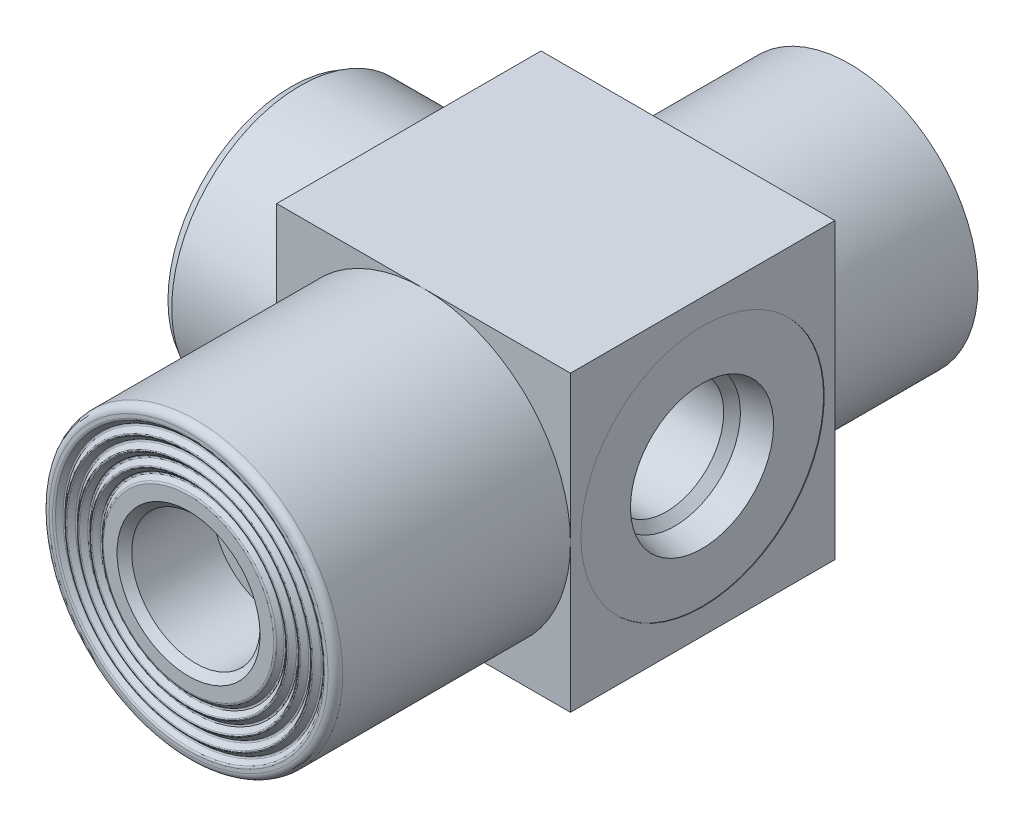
ISO-10303-21;
HEADER;
FILE_DESCRIPTION(('STEP AP214'),'2;1');
FILE_NAME('part.step','',(''),(''),'','','');
FILE_SCHEMA(('AUTOMOTIVE_DESIGN { 1 0 10303 214 1 1 1 1 }'));
ENDSEC;
DATA;
#1=APPLICATION_CONTEXT('core data for automotive mechanical design processes');
#2=APPLICATION_PROTOCOL_DEFINITION('international standard','automotive_design',2000,#1);
#3=PRODUCT_CONTEXT('',#1,'mechanical');
#4=PRODUCT('Part','Part','',(#3));
#5=PRODUCT_RELATED_PRODUCT_CATEGORY('part','',(#4));
#6=PRODUCT_DEFINITION_FORMATION('','',#4);
#7=PRODUCT_DEFINITION_CONTEXT('part definition',#1,'design');
#8=PRODUCT_DEFINITION('design','',#6,#7);
#9=PRODUCT_DEFINITION_SHAPE('','',#8);
#10=(LENGTH_UNIT() NAMED_UNIT(*) SI_UNIT(.MILLI.,.METRE.));
#11=(NAMED_UNIT(*) PLANE_ANGLE_UNIT() SI_UNIT($,.RADIAN.));
#12=(NAMED_UNIT(*) SI_UNIT($,.STERADIAN.) SOLID_ANGLE_UNIT());
#13=UNCERTAINTY_MEASURE_WITH_UNIT(LENGTH_MEASURE(1.E-05),#10,'distance_accuracy_value','');
#14=(GEOMETRIC_REPRESENTATION_CONTEXT(3) GLOBAL_UNCERTAINTY_ASSIGNED_CONTEXT((#13)) GLOBAL_UNIT_ASSIGNED_CONTEXT((#10,
#11,#12)) REPRESENTATION_CONTEXT('',''));
#15=CARTESIAN_POINT('',(0.,0.,0.));
#16=DIRECTION('',(0.,0.,1.));
#17=DIRECTION('',(1.,0.,0.));
#18=AXIS2_PLACEMENT_3D('',#15,#16,#17);
#19=CARTESIAN_POINT('',(12.7,-12.7,57.15));
#20=DIRECTION('',(0.,0.,1.));
#21=DIRECTION('',(1.,0.,0.));
#22=AXIS2_PLACEMENT_3D('',#19,#20,#21);
#23=PLANE('',#22);
#24=CARTESIAN_POINT('',(0.,0.,57.15));
#25=DIRECTION('',(0.,0.,1.));
#26=DIRECTION('',(1.,0.,0.));
#27=AXIS2_PLACEMENT_3D('',#24,#25,#26);
#28=CIRCLE('',#27,11.7638477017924);
#29=CARTESIAN_POINT('',(11.7638477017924,0.,57.15));
#30=VERTEX_POINT('',#29);
#31=EDGE_CURVE('E274',#30,#30,#28,.F.);
#32=ORIENTED_EDGE('',*,*,#31,.T.);
#33=EDGE_LOOP('',(#32));
#34=FACE_BOUND('',#33,.T.);
#35=CARTESIAN_POINT('',(0.,0.,57.15));
#36=DIRECTION('',(0.,0.,1.));
#37=DIRECTION('',(1.,0.,0.));
#38=AXIS2_PLACEMENT_3D('',#35,#36,#37);
#39=CIRCLE('',#38,12.065);
#40=CARTESIAN_POINT('',(12.065,0.,57.15));
#41=VERTEX_POINT('',#40);
#42=EDGE_CURVE('E249',#41,#41,#39,.T.);
#43=ORIENTED_EDGE('',*,*,#42,.T.);
#44=EDGE_LOOP('',(#43));
#45=FACE_BOUND('',#44,.T.);
#46=ADVANCED_FACE('F39',(#34,#45),#23,.T.);
#47=CARTESIAN_POINT('',(0.,0.,57.15));
#48=DIRECTION('',(0.,0.,1.));
#49=DIRECTION('',(1.,0.,0.));
#50=AXIS2_PLACEMENT_3D('',#47,#48,#49);
#51=CIRCLE('',#50,7.36238975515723);
#52=CARTESIAN_POINT('',(7.36238975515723,0.,57.15));
#53=VERTEX_POINT('',#52);
#54=EDGE_CURVE('E13',#53,#53,#51,.T.);
#55=ORIENTED_EDGE('',*,*,#54,.T.);
#56=EDGE_LOOP('',(#55));
#57=FACE_BOUND('',#56,.T.);
#58=CARTESIAN_POINT('',(0.,0.,57.15));
#59=DIRECTION('',(0.,0.,1.));
#60=DIRECTION('',(1.,0.,0.));
#61=AXIS2_PLACEMENT_3D('',#58,#59,#60);
#62=CIRCLE('',#61,6.1849);
#63=CARTESIAN_POINT('',(6.18490000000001,0.,57.15));
#64=VERTEX_POINT('',#63);
#65=EDGE_CURVE('E240',#64,#64,#62,.F.);
#66=ORIENTED_EDGE('',*,*,#65,.T.);
#67=EDGE_LOOP('',(#66));
#68=FACE_BOUND('',#67,.T.);
#69=ADVANCED_FACE('F298',(#57,#68),#23,.T.);
#70=CARTESIAN_POINT('',(-22.86,-12.7,57.15));
#71=DIRECTION('',(0.,1.,0.));
#72=DIRECTION('',(0.,0.,1.));
#73=AXIS2_PLACEMENT_3D('',#70,#71,#72);
#74=PLANE('',#73);
#75=DIRECTION('',(0.,0.,1.));
#76=VECTOR('',#75,1.);
#77=CARTESIAN_POINT('',(-12.7,-12.7,57.15));
#78=LINE('',#77,#76);
#79=CARTESIAN_POINT('',(-12.7,-12.7,13.97));
#80=VERTEX_POINT('',#79);
#81=CARTESIAN_POINT('',(-12.7,-12.7,36.83));
#82=VERTEX_POINT('',#81);
#83=EDGE_CURVE('E54',#80,#82,#78,.T.);
#84=ORIENTED_EDGE('',*,*,#83,.F.);
#85=DIRECTION('',(-1.,0.,0.));
#86=VECTOR('',#85,1.);
#87=CARTESIAN_POINT('',(-22.86,-12.7,13.97));
#88=LINE('',#87,#86);
#89=CARTESIAN_POINT('',(12.7,-12.7,13.97));
#90=VERTEX_POINT('',#89);
#91=EDGE_CURVE('E534',#90,#80,#88,.T.);
#92=ORIENTED_EDGE('',*,*,#91,.F.);
#93=DIRECTION('',(0.,0.,-1.));
#94=VECTOR('',#93,1.);
#95=CARTESIAN_POINT('',(12.7,-12.7,57.15));
#96=LINE('',#95,#94);
#97=CARTESIAN_POINT('',(12.7,-12.7,36.83));
#98=VERTEX_POINT('',#97);
#99=EDGE_CURVE('E441',#98,#90,#96,.T.);
#100=ORIENTED_EDGE('',*,*,#99,.F.);
#101=DIRECTION('',(1.,0.,0.));
#102=VECTOR('',#101,1.);
#103=CARTESIAN_POINT('',(-22.86,-12.7,36.83));
#104=LINE('',#103,#102);
#105=CARTESIAN_POINT('',(0.,-12.7,36.83));
#106=VERTEX_POINT('',#105);
#107=EDGE_CURVE('E552',#106,#98,#104,.T.);
#108=ORIENTED_EDGE('',*,*,#107,.F.);
#109=EDGE_CURVE('E132',#82,#106,#104,.T.);
#110=ORIENTED_EDGE('',*,*,#109,.F.);
#111=EDGE_LOOP('',(#84,#92,#100,#108,#110));
#112=FACE_BOUND('',#111,.T.);
#113=ADVANCED_FACE('F41',(#112),#74,.F.);
#114=CARTESIAN_POINT('',(-22.86,12.7,57.15));
#115=DIRECTION('',(0.,-1.,0.));
#116=DIRECTION('',(0.,0.,-1.));
#117=AXIS2_PLACEMENT_3D('',#114,#115,#116);
#118=PLANE('',#117);
#119=DIRECTION('',(0.,0.,-1.));
#120=VECTOR('',#119,1.);
#121=CARTESIAN_POINT('',(-12.7,12.7,57.15));
#122=LINE('',#121,#120);
#123=CARTESIAN_POINT('',(-12.7,12.7,36.83));
#124=VERTEX_POINT('',#123);
#125=CARTESIAN_POINT('',(-12.7,12.7,13.97));
#126=VERTEX_POINT('',#125);
#127=EDGE_CURVE('E128',#124,#126,#122,.T.);
#128=ORIENTED_EDGE('',*,*,#127,.F.);
#129=DIRECTION('',(-1.,0.,0.));
#130=VECTOR('',#129,1.);
#131=CARTESIAN_POINT('',(-22.86,12.7,36.83));
#132=LINE('',#131,#130);
#133=CARTESIAN_POINT('',(0.,12.7,36.83));
#134=VERTEX_POINT('',#133);
#135=EDGE_CURVE('E126',#134,#124,#132,.T.);
#136=ORIENTED_EDGE('',*,*,#135,.F.);
#137=CARTESIAN_POINT('',(12.7,12.7,36.83));
#138=VERTEX_POINT('',#137);
#139=EDGE_CURVE('E555',#138,#134,#132,.T.);
#140=ORIENTED_EDGE('',*,*,#139,.F.);
#141=DIRECTION('',(0.,0.,-1.));
#142=VECTOR('',#141,1.);
#143=CARTESIAN_POINT('',(12.7,12.7,57.15));
#144=LINE('',#143,#142);
#145=CARTESIAN_POINT('',(12.7,12.7,13.97));
#146=VERTEX_POINT('',#145);
#147=EDGE_CURVE('E537',#138,#146,#144,.T.);
#148=ORIENTED_EDGE('',*,*,#147,.T.);
#149=DIRECTION('',(1.,0.,0.));
#150=VECTOR('',#149,1.);
#151=CARTESIAN_POINT('',(-22.86,12.7,13.97));
#152=LINE('',#151,#150);
#153=EDGE_CURVE('E524',#126,#146,#152,.T.);
#154=ORIENTED_EDGE('',*,*,#153,.F.);
#155=EDGE_LOOP('',(#128,#136,#140,#148,#154));
#156=FACE_BOUND('',#155,.T.);
#157=ADVANCED_FACE('F559',(#156),#118,.F.);
#158=CARTESIAN_POINT('',(-22.86,12.7,57.15));
#159=DIRECTION('',(1.,0.,0.));
#160=DIRECTION('',(0.,1.,0.));
#161=AXIS2_PLACEMENT_3D('',#158,#159,#160);
#162=PLANE('',#161);
#163=CARTESIAN_POINT('',(-22.86,0.,25.4));
#164=DIRECTION('',(1.,0.,0.));
#165=DIRECTION('',(0.,1.,0.));
#166=AXIS2_PLACEMENT_3D('',#163,#164,#165);
#167=CIRCLE('',#166,10.6725590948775);
#168=CARTESIAN_POINT('',(-22.86,10.6725590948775,25.4));
#169=VERTEX_POINT('',#168);
#170=EDGE_CURVE('E225',#169,#169,#167,.F.);
#171=ORIENTED_EDGE('',*,*,#170,.T.);
#172=EDGE_LOOP('',(#171));
#173=FACE_BOUND('',#172,.T.);
#174=CARTESIAN_POINT('',(-22.86,0.,25.4));
#175=DIRECTION('',(1.,0.,0.));
#176=DIRECTION('',(0.,1.,0.));
#177=AXIS2_PLACEMENT_3D('',#174,#175,#176);
#178=CIRCLE('',#177,8.9027);
#179=CARTESIAN_POINT('',(-22.86,8.90270000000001,25.4));
#180=VERTEX_POINT('',#179);
#181=EDGE_CURVE('E222',#180,#180,#178,.T.);
#182=ORIENTED_EDGE('',*,*,#181,.T.);
#183=EDGE_LOOP('',(#182));
#184=FACE_BOUND('',#183,.T.);
#185=ADVANCED_FACE('F508',(#173,#184),#162,.F.);
#186=CARTESIAN_POINT('',(-5.08,0.,13.97));
#187=DIRECTION('',(0.,0.,-1.));
#188=DIRECTION('',(-1.,0.,0.));
#189=AXIS2_PLACEMENT_3D('',#186,#187,#188);
#190=PLANE('',#189);
#191=CARTESIAN_POINT('',(0.,0.,13.97));
#192=DIRECTION('',(0.,0.,-1.));
#193=DIRECTION('',(-1.,0.,0.));
#194=AXIS2_PLACEMENT_3D('',#191,#192,#193);
#195=CIRCLE('',#194,11.1125);
#196=CARTESIAN_POINT('',(-11.1125,0.,13.97));
#197=VERTEX_POINT('',#196);
#198=EDGE_CURVE('E520',#197,#197,#195,.T.);
#199=ORIENTED_EDGE('',*,*,#198,.F.);
#200=EDGE_LOOP('',(#199));
#201=FACE_BOUND('',#200,.T.);
#202=ORIENTED_EDGE('',*,*,#91,.T.);
#203=DIRECTION('',(0.,1.,0.));
#204=VECTOR('',#203,1.);
#205=CARTESIAN_POINT('',(-12.7,0.,13.97));
#206=LINE('',#205,#204);
#207=EDGE_CURVE('E401',#80,#126,#206,.T.);
#208=ORIENTED_EDGE('',*,*,#207,.T.);
#209=ORIENTED_EDGE('',*,*,#153,.T.);
#210=DIRECTION('',(0.,-1.,0.));
#211=VECTOR('',#210,1.);
#212=CARTESIAN_POINT('',(12.7,-12.7,13.97));
#213=LINE('',#212,#211);
#214=EDGE_CURVE('E531',#146,#90,#213,.T.);
#215=ORIENTED_EDGE('',*,*,#214,.T.);
#216=EDGE_LOOP('',(#202,#208,#209,#215));
#217=FACE_BOUND('',#216,.T.);
#218=ADVANCED_FACE('F491',(#201,#217),#190,.T.);
#219=CARTESIAN_POINT('',(-5.08,0.,36.83));
#220=DIRECTION('',(0.,0.,1.));
#221=DIRECTION('',(1.,0.,0.));
#222=AXIS2_PLACEMENT_3D('',#219,#220,#221);
#223=PLANE('',#222);
#224=ORIENTED_EDGE('',*,*,#135,.T.);
#225=DIRECTION('',(0.,-1.,0.));
#226=VECTOR('',#225,1.);
#227=CARTESIAN_POINT('',(-12.7,0.,36.83));
#228=LINE('',#227,#226);
#229=CARTESIAN_POINT('',(-12.7,0.,36.83));
#230=VERTEX_POINT('',#229);
#231=EDGE_CURVE('E111',#124,#230,#228,.T.);
#232=ORIENTED_EDGE('',*,*,#231,.T.);
#233=CARTESIAN_POINT('',(0.,0.,36.83));
#234=DIRECTION('',(0.,0.,1.));
#235=DIRECTION('',(1.,0.,0.));
#236=AXIS2_PLACEMENT_3D('',#233,#234,#235);
#237=CIRCLE('',#236,12.7);
#238=EDGE_CURVE('E123',#134,#230,#237,.T.);
#239=ORIENTED_EDGE('',*,*,#238,.F.);
#240=EDGE_LOOP('',(#224,#232,#239));
#241=FACE_BOUND('',#240,.T.);
#242=ADVANCED_FACE('F121',(#241),#223,.T.);
#243=EDGE_CURVE('E130',#230,#106,#237,.T.);
#244=ORIENTED_EDGE('',*,*,#243,.F.);
#245=EDGE_CURVE('E107',#230,#82,#228,.T.);
#246=ORIENTED_EDGE('',*,*,#245,.T.);
#247=ORIENTED_EDGE('',*,*,#109,.T.);
#248=EDGE_LOOP('',(#244,#246,#247));
#249=FACE_BOUND('',#248,.T.);
#250=ADVANCED_FACE('F131',(#249),#223,.T.);
#251=CARTESIAN_POINT('',(5.69683189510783E-12,0.,25.4));
#252=DIRECTION('',(1.,0.,0.));
#253=DIRECTION('',(0.,1.,0.));
#254=AXIS2_PLACEMENT_3D('',#251,#252,#253);
#255=CYLINDRICAL_SURFACE('',#254,4.96062);
#256=CARTESIAN_POINT('',(9.56482110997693,0.,25.4));
#257=DIRECTION('',(1.,0.,0.));
#258=DIRECTION('',(0.,1.,0.));
#259=AXIS2_PLACEMENT_3D('',#256,#257,#258);
#260=CIRCLE('',#259,4.96062);
#261=CARTESIAN_POINT('',(9.56482110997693,4.96062000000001,25.4));
#262=VERTEX_POINT('',#261);
#263=EDGE_CURVE('E407',#262,#262,#260,.T.);
#264=ORIENTED_EDGE('',*,*,#263,.T.);
#265=EDGE_LOOP('',(#264));
#266=FACE_BOUND('',#265,.T.);
#267=CARTESIAN_POINT('',(5.69683189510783E-12,0.,25.4));
#268=DIRECTION('',(1.,0.,0.));
#269=DIRECTION('',(0.,1.,0.));
#270=AXIS2_PLACEMENT_3D('',#267,#268,#269);
#271=CIRCLE('',#270,4.96062);
#272=CARTESIAN_POINT('',(5.69683189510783E-12,4.826,24.2521869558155));
#273=VERTEX_POINT('',#272);
#274=CARTESIAN_POINT('',(5.69683189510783E-12,4.826,26.5478130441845));
#275=VERTEX_POINT('',#274);
#276=EDGE_CURVE('E419',#273,#275,#271,.T.);
#277=ORIENTED_EDGE('',*,*,#276,.F.);
#278=CARTESIAN_POINT('',(5.69683189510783E-12,-4.826,24.2521869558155));
#279=CARTESIAN_POINT('',(0.0398789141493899,-4.82600520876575,24.2522296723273));
#280=CARTESIAN_POINT('',(0.0797139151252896,-4.8255056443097,24.2501079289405));
#281=CARTESIAN_POINT('',(0.158826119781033,-4.82354626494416,24.2419058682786));
#282=CARTESIAN_POINT('',(0.198104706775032,-4.82208954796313,24.2358383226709));
#283=CARTESIAN_POINT('',(0.313109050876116,-4.81643479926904,24.2125868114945));
#284=CARTESIAN_POINT('',(0.387750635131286,-4.81094745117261,24.1903212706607));
#285=CARTESIAN_POINT('',(0.521286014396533,-4.79815678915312,24.1406420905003));
#286=CARTESIAN_POINT('',(0.580782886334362,-4.79128701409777,24.1146307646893));
#287=CARTESIAN_POINT('',(0.697290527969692,-4.77572047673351,24.0579425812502));
#288=CARTESIAN_POINT('',(0.754299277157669,-4.76702226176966,24.0272620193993));
#289=CARTESIAN_POINT('',(0.923665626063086,-4.73818654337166,23.9296515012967));
#290=CARTESIAN_POINT('',(1.03274059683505,-4.71547485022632,23.8578518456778));
#291=CARTESIAN_POINT('',(1.22071748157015,-4.66981571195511,23.7253775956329));
#292=CARTESIAN_POINT('',(1.30082115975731,-4.6481067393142,23.665907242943));
#293=CARTESIAN_POINT('',(1.45833261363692,-4.60111887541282,23.5448269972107));
#294=CARTESIAN_POINT('',(1.535740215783,-4.57583975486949,23.4832169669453));
#295=CARTESIAN_POINT('',(1.7649207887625,-4.49462795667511,23.2965592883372));
#296=CARTESIAN_POINT('',(1.91345695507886,-4.43336901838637,23.1698286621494));
#297=CARTESIAN_POINT('',(2.20317991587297,-4.29671721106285,22.9167227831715));
#298=CARTESIAN_POINT('',(2.34438918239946,-4.22137127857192,22.7903477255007));
#299=CARTESIAN_POINT('',(2.62009473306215,-4.05600774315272,22.540100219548));
#300=CARTESIAN_POINT('',(2.75459636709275,-3.96600208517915,22.416225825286));
#301=CARTESIAN_POINT('',(2.98977531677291,-3.7905701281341,22.1976932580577));
#302=CARTESIAN_POINT('',(3.09176933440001,-3.70793394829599,22.1022159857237));
#303=CARTESIAN_POINT('',(3.29058385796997,-3.53269252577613,21.9151347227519));
#304=CARTESIAN_POINT('',(3.38740364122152,-3.44008589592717,21.8235312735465));
#305=CARTESIAN_POINT('',(3.6687279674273,-3.14704398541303,21.5563606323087));
#306=CARTESIAN_POINT('',(3.84458255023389,-2.93103287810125,21.3879788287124));
#307=CARTESIAN_POINT('',(4.12242106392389,-2.51812522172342,21.1208877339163));
#308=CARTESIAN_POINT('',(4.2317786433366,-2.33056174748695,21.0153900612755));
#309=CARTESIAN_POINT('',(4.42729679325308,-1.93341726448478,20.826402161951));
#310=CARTESIAN_POINT('',(4.51348585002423,-1.7238637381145,20.7428849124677));
#311=CARTESIAN_POINT('',(4.64630532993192,-1.31924657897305,20.6140400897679));
#312=CARTESIAN_POINT('',(4.69693298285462,-1.12673392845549,20.5648606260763));
#313=CARTESIAN_POINT('',(4.77429403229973,-0.732557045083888,20.4896768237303));
#314=CARTESIAN_POINT('',(4.80104120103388,-0.530898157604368,20.4636591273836));
#315=CARTESIAN_POINT('',(4.8287472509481,-0.123531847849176,20.4367083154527));
#316=CARTESIAN_POINT('',(4.82963241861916,0.0821854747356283,20.4358469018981));
#317=CARTESIAN_POINT('',(4.80535723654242,0.490595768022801,20.4594610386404));
#318=CARTESIAN_POINT('',(4.78019290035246,0.693288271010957,20.4839404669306));
#319=CARTESIAN_POINT('',(4.70726301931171,1.08135298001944,20.5548240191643));
#320=CARTESIAN_POINT('',(4.66049293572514,1.2670951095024,20.6002623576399));
#321=CARTESIAN_POINT('',(4.54751244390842,1.62664657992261,20.7098871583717));
#322=CARTESIAN_POINT('',(4.48129596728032,1.80045217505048,20.7740794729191));
#323=CARTESIAN_POINT('',(4.30291658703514,2.20003989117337,20.946700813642));
#324=CARTESIAN_POINT('',(4.1829451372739,2.41911719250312,21.0625787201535));
#325=CARTESIAN_POINT('',(3.91848884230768,2.8275839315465,21.3170215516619));
#326=CARTESIAN_POINT('',(3.77394256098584,3.01689661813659,21.4556433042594));
#327=CARTESIAN_POINT('',(3.51491845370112,3.31073841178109,21.7025523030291));
#328=CARTESIAN_POINT('',(3.40527758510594,3.42320903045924,21.8066720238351));
#329=CARTESIAN_POINT('',(3.17870519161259,3.63457212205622,22.0206148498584));
#330=CARTESIAN_POINT('',(3.06177323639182,3.73346379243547,22.1304382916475));
#331=CARTESIAN_POINT('',(2.82174130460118,3.91803022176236,22.354053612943));
#332=CARTESIAN_POINT('',(2.69864628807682,4.00371538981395,22.4678422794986));
#333=CARTESIAN_POINT('',(2.44680587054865,4.16239911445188,22.6978363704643));
#334=CARTESIAN_POINT('',(2.3180626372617,4.23540248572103,22.8140408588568));
#335=CARTESIAN_POINT('',(2.05140840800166,4.37092325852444,23.050154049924));
#336=CARTESIAN_POINT('',(1.91334491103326,4.43311172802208,23.1700793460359));
#337=CARTESIAN_POINT('',(1.63007634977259,4.54493204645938,23.4078674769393));
#338=CARTESIAN_POINT('',(1.48485979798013,4.5945428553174,23.5257265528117));
#339=CARTESIAN_POINT('',(1.20915086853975,4.67390075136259,23.7348669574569));
#340=CARTESIAN_POINT('',(1.08015957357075,4.7055722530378,23.8273333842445));
#341=CARTESIAN_POINT('',(0.878631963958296,4.74583191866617,23.955400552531));
#342=CARTESIAN_POINT('',(0.810213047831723,4.75803235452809,23.996269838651));
#343=CARTESIAN_POINT('',(0.669922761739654,4.77980293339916,24.0723017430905));
#344=CARTESIAN_POINT('',(0.598057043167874,4.78937721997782,24.1074733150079));
#345=CARTESIAN_POINT('',(0.455088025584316,4.80499684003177,24.1668596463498));
#346=CARTESIAN_POINT('',(0.38425304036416,4.81123481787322,24.191648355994));
#347=CARTESIAN_POINT('',(0.239471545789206,4.82059120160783,24.229501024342));
#348=CARTESIAN_POINT('',(0.165543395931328,4.82372587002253,24.2426260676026));
#349=CARTESIAN_POINT('',(0.0607831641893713,4.82571600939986,24.2510010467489));
#350=CARTESIAN_POINT('',(0.0303953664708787,4.82600678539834,24.2522356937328));
#351=CARTESIAN_POINT('',(5.69683189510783E-12,4.826,24.2521869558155));
#352=B_SPLINE_CURVE_WITH_KNOTS('',3,(#278,#279,#280,#281,#282,#283,#284,#285,#286,#287,#288,
#289,#290,#291,#292,#293,#294,#295,#296,#297,#298,#299,#300,#301,#302,#303,#304,#305,#306,#307,
#308,#309,#310,#311,#312,#313,#314,#315,#316,#317,#318,#319,#320,#321,#322,#323,#324,#325,#326,
#327,#328,#329,#330,#331,#332,#333,#334,#335,#336,#337,#338,#339,#340,#341,#342,#343,#344,#345,
#346,#347,#348,#349,#350,#351),.UNSPECIFIED.,.F.,.F.,(4,2,2,2,2,2,2,2,2,2,2,2,2,2,2,2,2,2,2,2,2,
2,2,2,2,2,2,2,2,2,2,2,2,2,2,2,4),(0.,0.11950319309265,0.238621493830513,0.471707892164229,
0.667336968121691,0.863122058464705,1.25996929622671,1.56618276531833,1.87241590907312,
2.48562111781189,3.09681846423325,3.70752026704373,4.19404562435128,4.68063875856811,
5.65158799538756,6.373233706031,7.09398803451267,7.70648761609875,8.31863373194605,
8.93252445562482,9.54650913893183,10.134661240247,10.7229970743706,11.5445336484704,
12.3681550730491,12.9327965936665,13.4974714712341,14.0616989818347,14.625711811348,
15.2046626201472,15.7845756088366,16.2692050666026,16.5108728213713,16.7521570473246,
16.9773628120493,17.2013820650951,17.2925403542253),.UNSPECIFIED.);
#353=CARTESIAN_POINT('',(5.69683189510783E-12,-4.826,24.2521869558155));
#354=VERTEX_POINT('',#353);
#355=EDGE_CURVE('E201',#354,#273,#352,.T.);
#356=ORIENTED_EDGE('',*,*,#355,.F.);
#357=CARTESIAN_POINT('',(5.69683189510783E-12,-4.826,26.5478130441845));
#358=VERTEX_POINT('',#357);
#359=EDGE_CURVE('E62',#358,#354,#271,.T.);
#360=ORIENTED_EDGE('',*,*,#359,.F.);
#361=CARTESIAN_POINT('',(5.69683189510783E-12,4.826,26.5478130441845));
#362=CARTESIAN_POINT('',(0.0398789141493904,4.82600520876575,26.5477703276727));
#363=CARTESIAN_POINT('',(0.0797139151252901,4.8255056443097,26.5498920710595));
#364=CARTESIAN_POINT('',(0.158826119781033,4.82354626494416,26.5580941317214));
#365=CARTESIAN_POINT('',(0.198104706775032,4.82208954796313,26.5641616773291));
#366=CARTESIAN_POINT('',(0.313109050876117,4.81643479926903,26.5874131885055));
#367=CARTESIAN_POINT('',(0.387750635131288,4.81094745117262,26.6096787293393));
#368=CARTESIAN_POINT('',(0.521286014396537,4.79815678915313,26.6593579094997));
#369=CARTESIAN_POINT('',(0.580782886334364,4.79128701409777,26.6853692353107));
#370=CARTESIAN_POINT('',(0.697290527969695,4.77572047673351,26.7420574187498));
#371=CARTESIAN_POINT('',(0.754299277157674,4.76702226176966,26.7727379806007));
#372=CARTESIAN_POINT('',(0.923665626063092,4.73818654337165,26.8703484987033));
#373=CARTESIAN_POINT('',(1.03274059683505,4.71547485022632,26.9421481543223));
#374=CARTESIAN_POINT('',(1.22071748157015,4.66981571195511,27.0746224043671));
#375=CARTESIAN_POINT('',(1.30082115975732,4.6481067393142,27.134092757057));
#376=CARTESIAN_POINT('',(1.45833261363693,4.60111887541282,27.2551730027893));
#377=CARTESIAN_POINT('',(1.53574021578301,4.57583975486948,27.3167830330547));
#378=CARTESIAN_POINT('',(1.76492078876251,4.49462795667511,27.5034407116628));
#379=CARTESIAN_POINT('',(1.91345695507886,4.43336901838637,27.6301713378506));
#380=CARTESIAN_POINT('',(2.20317991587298,4.29671721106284,27.8832772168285));
#381=CARTESIAN_POINT('',(2.34438918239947,4.22137127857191,28.0096522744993));
#382=CARTESIAN_POINT('',(2.62009473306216,4.05600774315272,28.259899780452));
#383=CARTESIAN_POINT('',(2.75459636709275,3.96600208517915,28.383774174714));
#384=CARTESIAN_POINT('',(2.98977531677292,3.7905701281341,28.6023067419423));
#385=CARTESIAN_POINT('',(3.09176933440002,3.70793394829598,28.6977840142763));
#386=CARTESIAN_POINT('',(3.29058385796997,3.53269252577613,28.8848652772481));
#387=CARTESIAN_POINT('',(3.38740364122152,3.44008589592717,28.9764687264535));
#388=CARTESIAN_POINT('',(3.6687279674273,3.14704398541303,29.2436393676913));
#389=CARTESIAN_POINT('',(3.8445825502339,2.93103287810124,29.4120211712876));
#390=CARTESIAN_POINT('',(4.1224210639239,2.51812522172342,29.6791122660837));
#391=CARTESIAN_POINT('',(4.2317786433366,2.33056174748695,29.7846099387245));
#392=CARTESIAN_POINT('',(4.42729679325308,1.93341726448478,29.973597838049));
#393=CARTESIAN_POINT('',(4.51348585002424,1.72386373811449,30.0571150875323));
#394=CARTESIAN_POINT('',(4.64630532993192,1.31924657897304,30.1859599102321));
#395=CARTESIAN_POINT('',(4.69693298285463,1.12673392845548,30.2351393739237));
#396=CARTESIAN_POINT('',(4.77429403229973,0.732557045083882,30.3103231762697));
#397=CARTESIAN_POINT('',(4.80104120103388,0.530898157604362,30.3363408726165));
#398=CARTESIAN_POINT('',(4.8287472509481,0.12353184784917,30.3632916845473));
#399=CARTESIAN_POINT('',(4.82963241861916,-0.0821854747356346,30.3641530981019));
#400=CARTESIAN_POINT('',(4.80535723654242,-0.490595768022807,30.3405389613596));
#401=CARTESIAN_POINT('',(4.78019290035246,-0.693288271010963,30.3160595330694));
#402=CARTESIAN_POINT('',(4.70726301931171,-1.08135298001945,30.2451759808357));
#403=CARTESIAN_POINT('',(4.66049293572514,-1.2670951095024,30.1997376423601));
#404=CARTESIAN_POINT('',(4.54751244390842,-1.62664657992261,30.0901128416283));
#405=CARTESIAN_POINT('',(4.48129596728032,-1.80045217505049,30.0259205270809));
#406=CARTESIAN_POINT('',(4.30291658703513,-2.20003989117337,29.853299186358));
#407=CARTESIAN_POINT('',(4.18294513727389,-2.41911719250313,29.7374212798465));
#408=CARTESIAN_POINT('',(3.91848884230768,-2.82758393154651,29.4829784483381));
#409=CARTESIAN_POINT('',(3.77394256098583,-3.0168966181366,29.3443566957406));
#410=CARTESIAN_POINT('',(3.51491845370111,-3.3107384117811,29.0974476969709));
#411=CARTESIAN_POINT('',(3.40527758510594,-3.42320903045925,28.9933279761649));
#412=CARTESIAN_POINT('',(3.17870519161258,-3.63457212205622,28.7793851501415));
#413=CARTESIAN_POINT('',(3.06177323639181,-3.73346379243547,28.6695617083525));
#414=CARTESIAN_POINT('',(2.82174130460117,-3.91803022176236,28.445946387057));
#415=CARTESIAN_POINT('',(2.69864628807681,-4.00371538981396,28.3321577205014));
#416=CARTESIAN_POINT('',(2.44680587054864,-4.16239911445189,28.1021636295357));
#417=CARTESIAN_POINT('',(2.31806263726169,-4.23540248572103,27.9859591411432));
#418=CARTESIAN_POINT('',(2.05140840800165,-4.37092325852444,27.749845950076));
#419=CARTESIAN_POINT('',(1.91334491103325,-4.43311172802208,27.6299206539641));
#420=CARTESIAN_POINT('',(1.63007634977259,-4.54493204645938,27.3921325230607));
#421=CARTESIAN_POINT('',(1.48485979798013,-4.5945428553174,27.2742734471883));
#422=CARTESIAN_POINT('',(1.20915086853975,-4.67390075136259,27.0651330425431));
#423=CARTESIAN_POINT('',(1.08015957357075,-4.7055722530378,26.9726666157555));
#424=CARTESIAN_POINT('',(0.878631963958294,-4.74583191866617,26.844599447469));
#425=CARTESIAN_POINT('',(0.810213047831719,-4.75803235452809,26.803730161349));
#426=CARTESIAN_POINT('',(0.669922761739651,-4.77980293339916,26.7276982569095));
#427=CARTESIAN_POINT('',(0.598057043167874,-4.78937721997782,26.6925266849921));
#428=CARTESIAN_POINT('',(0.455088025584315,-4.80499684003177,26.6331403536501));
#429=CARTESIAN_POINT('',(0.384253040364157,-4.81123481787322,26.608351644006));
#430=CARTESIAN_POINT('',(0.239471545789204,-4.82059120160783,26.570498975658));
#431=CARTESIAN_POINT('',(0.165543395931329,-4.82372587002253,26.5573739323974));
#432=CARTESIAN_POINT('',(0.0607831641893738,-4.82571600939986,26.548998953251));
#433=CARTESIAN_POINT('',(0.0303953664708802,-4.82600678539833,26.5477643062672));
#434=CARTESIAN_POINT('',(5.69683189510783E-12,-4.826,26.5478130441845));
#435=B_SPLINE_CURVE_WITH_KNOTS('',3,(#361,#362,#363,#364,#365,#366,#367,#368,#369,#370,#371,
#372,#373,#374,#375,#376,#377,#378,#379,#380,#381,#382,#383,#384,#385,#386,#387,#388,#389,#390,
#391,#392,#393,#394,#395,#396,#397,#398,#399,#400,#401,#402,#403,#404,#405,#406,#407,#408,#409,
#410,#411,#412,#413,#414,#415,#416,#417,#418,#419,#420,#421,#422,#423,#424,#425,#426,#427,#428,
#429,#430,#431,#432,#433,#434),.UNSPECIFIED.,.F.,.F.,(4,2,2,2,2,2,2,2,2,2,2,2,2,2,2,2,2,2,2,2,2,
2,2,2,2,2,2,2,2,2,2,2,2,2,2,2,4),(0.,0.11950319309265,0.238621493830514,0.471707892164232,
0.667336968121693,0.863122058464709,1.25996929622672,1.56618276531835,1.87241590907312,
2.4856211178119,3.09681846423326,3.70752026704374,4.19404562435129,4.68063875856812,
5.65158799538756,6.37323370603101,7.09398803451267,7.70648761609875,8.31863373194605,
8.93252445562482,9.54650913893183,10.134661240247,10.7229970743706,11.5445336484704,
12.3681550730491,12.9327965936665,13.4974714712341,14.0616989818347,14.625711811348,
15.2046626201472,15.7845756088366,16.2692050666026,16.5108728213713,16.7521570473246,
16.9773628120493,17.2013820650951,17.2925403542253),.UNSPECIFIED.);
#436=EDGE_CURVE('E175',#275,#358,#435,.T.);
#437=ORIENTED_EDGE('',*,*,#436,.F.);
#438=EDGE_LOOP('',(#277,#356,#360,#437));
#439=FACE_BOUND('',#438,.T.);
#440=ADVANCED_FACE('F189',(#266,#439),#255,.F.);
#441=CARTESIAN_POINT('',(0.,0.,-3.81));
#442=DIRECTION('',(0.,0.,1.));
#443=DIRECTION('',(1.,0.,0.));
#444=AXIS2_PLACEMENT_3D('',#441,#442,#443);
#445=CYLINDRICAL_SURFACE('',#444,4.826);
#446=CARTESIAN_POINT('',(0.,0.,46.99));
#447=DIRECTION('',(0.,0.,1.));
#448=DIRECTION('',(1.,0.,0.));
#449=AXIS2_PLACEMENT_3D('',#446,#447,#448);
#450=CIRCLE('',#449,4.826);
#451=CARTESIAN_POINT('',(4.826,0.,46.99));
#452=VERTEX_POINT('',#451);
#453=EDGE_CURVE('E166',#452,#452,#450,.T.);
#454=ORIENTED_EDGE('',*,*,#453,.T.);
#455=EDGE_LOOP('',(#454));
#456=FACE_BOUND('',#455,.T.);
#457=DIRECTION('',(0.,0.,1.));
#458=VECTOR('',#457,1.);
#459=CARTESIAN_POINT('',(5.69683189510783E-12,4.826,-3.81));
#460=LINE('',#459,#458);
#461=CARTESIAN_POINT('',(5.69683189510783E-12,4.82600000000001,25.4));
#462=VERTEX_POINT('',#461);
#463=EDGE_CURVE('E183',#275,#462,#460,.F.);
#464=ORIENTED_EDGE('',*,*,#463,.F.);
#465=ORIENTED_EDGE('',*,*,#436,.T.);
#466=DIRECTION('',(0.,0.,1.));
#467=VECTOR('',#466,1.);
#468=CARTESIAN_POINT('',(5.69683189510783E-12,-4.826,-3.81));
#469=LINE('',#468,#467);
#470=CARTESIAN_POINT('',(5.69683189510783E-12,-4.826,25.3999999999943));
#471=VERTEX_POINT('',#470);
#472=EDGE_CURVE('E424',#471,#358,#469,.T.);
#473=ORIENTED_EDGE('',*,*,#472,.F.);
#474=CARTESIAN_POINT('',(0.,0.,25.4));
#475=DIRECTION('',(0.707106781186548,0.,0.707106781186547));
#476=DIRECTION('',(-0.707106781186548,0.,0.707106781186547));
#477=AXIS2_PLACEMENT_3D('',#474,#475,#476);
#478=ELLIPSE('',#477,6.82499465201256,4.826);
#479=EDGE_CURVE('E439',#471,#462,#478,.F.);
#480=ORIENTED_EDGE('',*,*,#479,.T.);
#481=EDGE_LOOP('',(#464,#465,#473,#480));
#482=FACE_BOUND('',#481,.T.);
#483=ADVANCED_FACE('F185',(#456,#482),#445,.F.);
#484=CARTESIAN_POINT('',(0.,0.,17.8456060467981));
#485=DIRECTION('',(0.,0.,-1.));
#486=DIRECTION('',(-1.,0.,0.));
#487=AXIS2_PLACEMENT_3D('',#484,#485,#486);
#488=CIRCLE('',#487,4.826);
#489=CARTESIAN_POINT('',(-4.826,0.,17.8456060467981));
#490=VERTEX_POINT('',#489);
#491=EDGE_CURVE('E208',#490,#490,#488,.T.);
#492=ORIENTED_EDGE('',*,*,#491,.T.);
#493=EDGE_LOOP('',(#492));
#494=FACE_BOUND('',#493,.T.);
#495=DIRECTION('',(0.,0.,1.));
#496=VECTOR('',#495,1.);
#497=CARTESIAN_POINT('',(5.69683189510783E-12,4.826,-3.81));
#498=LINE('',#497,#496);
#499=EDGE_CURVE('E425',#462,#273,#498,.F.);
#500=ORIENTED_EDGE('',*,*,#499,.F.);
#501=CARTESIAN_POINT('',(0.,0.,25.4));
#502=DIRECTION('',(-0.707106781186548,0.,0.707106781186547));
#503=DIRECTION('',(0.707106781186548,0.,0.707106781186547));
#504=AXIS2_PLACEMENT_3D('',#501,#502,#503);
#505=ELLIPSE('',#504,6.82499465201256,4.826);
#506=EDGE_CURVE('E209',#462,#471,#505,.T.);
#507=ORIENTED_EDGE('',*,*,#506,.T.);
#508=DIRECTION('',(0.,0.,1.));
#509=VECTOR('',#508,1.);
#510=CARTESIAN_POINT('',(5.69683189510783E-12,-4.826,-3.81));
#511=LINE('',#510,#509);
#512=EDGE_CURVE('E422',#354,#471,#511,.T.);
#513=ORIENTED_EDGE('',*,*,#512,.F.);
#514=ORIENTED_EDGE('',*,*,#355,.T.);
#515=EDGE_LOOP('',(#500,#507,#513,#514));
#516=FACE_BOUND('',#515,.T.);
#517=ADVANCED_FACE('F434',(#494,#516),#445,.F.);
#518=CARTESIAN_POINT('',(12.7,-12.7,57.15));
#519=DIRECTION('',(-1.,0.,0.));
#520=DIRECTION('',(0.,-1.,0.));
#521=AXIS2_PLACEMENT_3D('',#518,#519,#520);
#522=PLANE('',#521);
#523=CARTESIAN_POINT('',(12.7,0.,25.4));
#524=DIRECTION('',(1.,0.,0.));
#525=DIRECTION('',(0.,1.,0.));
#526=AXIS2_PLACEMENT_3D('',#523,#524,#525);
#527=CIRCLE('',#526,10.5156);
#528=CARTESIAN_POINT('',(12.7,10.5156,25.4));
#529=VERTEX_POINT('',#528);
#530=EDGE_CURVE('E413',#529,#529,#527,.T.);
#531=ORIENTED_EDGE('',*,*,#530,.F.);
#532=EDGE_LOOP('',(#531));
#533=FACE_BOUND('',#532,.T.);
#534=DIRECTION('',(0.,1.,0.));
#535=VECTOR('',#534,1.);
#536=CARTESIAN_POINT('',(12.7,-12.7,36.83));
#537=LINE('',#536,#535);
#538=CARTESIAN_POINT('',(12.7,0.,36.83));
#539=VERTEX_POINT('',#538);
#540=EDGE_CURVE('E546',#98,#539,#537,.T.);
#541=ORIENTED_EDGE('',*,*,#540,.F.);
#542=ORIENTED_EDGE('',*,*,#99,.T.);
#543=ORIENTED_EDGE('',*,*,#214,.F.);
#544=ORIENTED_EDGE('',*,*,#147,.F.);
#545=EDGE_CURVE('E554',#539,#138,#537,.T.);
#546=ORIENTED_EDGE('',*,*,#545,.F.);
#547=EDGE_LOOP('',(#541,#542,#543,#544,#546));
#548=FACE_BOUND('',#547,.T.);
#549=ADVANCED_FACE('F505',(#533,#548),#522,.F.);
#550=CARTESIAN_POINT('',(0.,0.,13.97));
#551=DIRECTION('',(0.,0.,-1.));
#552=DIRECTION('',(-1.,0.,0.));
#553=AXIS2_PLACEMENT_3D('',#550,#551,#552);
#554=CYLINDRICAL_SURFACE('',#553,11.1125);
#555=ORIENTED_EDGE('',*,*,#198,.T.);
#556=EDGE_LOOP('',(#555));
#557=FACE_BOUND('',#556,.T.);
#558=CARTESIAN_POINT('',(0.,0.,0.));
#559=DIRECTION('',(0.,0.,-1.));
#560=DIRECTION('',(-1.,0.,0.));
#561=AXIS2_PLACEMENT_3D('',#558,#559,#560);
#562=CIRCLE('',#561,11.1125);
#563=CARTESIAN_POINT('',(-11.1125,0.,0.));
#564=VERTEX_POINT('',#563);
#565=EDGE_CURVE('E518',#564,#564,#562,.T.);
#566=ORIENTED_EDGE('',*,*,#565,.F.);
#567=EDGE_LOOP('',(#566));
#568=FACE_BOUND('',#567,.T.);
#569=ADVANCED_FACE('F502',(#557,#568),#554,.T.);
#570=CARTESIAN_POINT('',(12.7,-12.7,0.));
#571=DIRECTION('',(0.,0.,1.));
#572=DIRECTION('',(1.,0.,0.));
#573=AXIS2_PLACEMENT_3D('',#570,#571,#572);
#574=PLANE('',#573);
#575=CARTESIAN_POINT('',(0.,0.,0.));
#576=DIRECTION('',(0.,0.,1.));
#577=DIRECTION('',(1.,0.,0.));
#578=AXIS2_PLACEMENT_3D('',#575,#576,#577);
#579=CIRCLE('',#578,8.4455);
#580=CARTESIAN_POINT('',(8.44550000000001,0.,0.));
#581=VERTEX_POINT('',#580);
#582=EDGE_CURVE('E234',#581,#581,#579,.T.);
#583=ORIENTED_EDGE('',*,*,#582,.T.);
#584=EDGE_LOOP('',(#583));
#585=FACE_BOUND('',#584,.T.);
#586=ORIENTED_EDGE('',*,*,#565,.T.);
#587=EDGE_LOOP('',(#586));
#588=FACE_BOUND('',#587,.T.);
#589=ADVANCED_FACE('F500',(#585,#588),#574,.F.);
#590=CARTESIAN_POINT('',(0.,0.,6.858));
#591=DIRECTION('',(0.,0.,-1.));
#592=DIRECTION('',(-1.,0.,0.));
#593=AXIS2_PLACEMENT_3D('',#590,#591,#592);
#594=CYLINDRICAL_SURFACE('',#593,7.9375);
#595=CARTESIAN_POINT('',(0.,0.,0.879881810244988));
#596=DIRECTION('',(0.,0.,1.));
#597=DIRECTION('',(1.,0.,0.));
#598=AXIS2_PLACEMENT_3D('',#595,#596,#597);
#599=CIRCLE('',#598,7.9375);
#600=CARTESIAN_POINT('',(7.93750000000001,0.,0.879881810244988));
#601=VERTEX_POINT('',#600);
#602=EDGE_CURVE('E231',#601,#601,#599,.F.);
#603=ORIENTED_EDGE('',*,*,#602,.T.);
#604=EDGE_LOOP('',(#603));
#605=FACE_BOUND('',#604,.T.);
#606=CARTESIAN_POINT('',(0.,0.,6.858));
#607=DIRECTION('',(0.,0.,-1.));
#608=DIRECTION('',(-1.,0.,0.));
#609=AXIS2_PLACEMENT_3D('',#606,#607,#608);
#610=CIRCLE('',#609,7.9375);
#611=CARTESIAN_POINT('',(-7.93750000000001,0.,6.858));
#612=VERTEX_POINT('',#611);
#613=EDGE_CURVE('E521',#612,#612,#610,.T.);
#614=ORIENTED_EDGE('',*,*,#613,.F.);
#615=EDGE_LOOP('',(#614));
#616=FACE_BOUND('',#615,.T.);
#617=ADVANCED_FACE('F496',(#605,#616),#594,.F.);
#618=CARTESIAN_POINT('',(0.,0.,6.858));
#619=DIRECTION('',(0.,0.,-1.));
#620=DIRECTION('',(-1.,0.,0.));
#621=AXIS2_PLACEMENT_3D('',#618,#619,#620);
#622=PLANE('',#621);
#623=CARTESIAN_POINT('',(0.,0.,6.858));
#624=DIRECTION('',(0.,0.,-1.));
#625=DIRECTION('',(-1.,0.,0.));
#626=AXIS2_PLACEMENT_3D('',#623,#624,#625);
#627=CIRCLE('',#626,7.112);
#628=CARTESIAN_POINT('',(-7.11200000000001,0.,6.858));
#629=VERTEX_POINT('',#628);
#630=EDGE_CURVE('E216',#629,#629,#627,.F.);
#631=ORIENTED_EDGE('',*,*,#630,.T.);
#632=EDGE_LOOP('',(#631));
#633=FACE_BOUND('',#632,.T.);
#634=ORIENTED_EDGE('',*,*,#613,.T.);
#635=EDGE_LOOP('',(#634));
#636=FACE_BOUND('',#635,.T.);
#637=ADVANCED_FACE('F492',(#633,#636),#622,.T.);
#638=ORIENTED_EDGE('',*,*,#107,.T.);
#639=ORIENTED_EDGE('',*,*,#540,.T.);
#640=EDGE_CURVE('E136',#106,#539,#237,.T.);
#641=ORIENTED_EDGE('',*,*,#640,.F.);
#642=EDGE_LOOP('',(#638,#639,#641));
#643=FACE_BOUND('',#642,.T.);
#644=ADVANCED_FACE('F495',(#643),#223,.T.);
#645=ORIENTED_EDGE('',*,*,#545,.T.);
#646=ORIENTED_EDGE('',*,*,#139,.T.);
#647=EDGE_CURVE('E138',#539,#134,#237,.T.);
#648=ORIENTED_EDGE('',*,*,#647,.F.);
#649=EDGE_LOOP('',(#645,#646,#648));
#650=FACE_BOUND('',#649,.T.);
#651=ADVANCED_FACE('F487',(#650),#223,.T.);
#652=CARTESIAN_POINT('',(0.,0.,36.83));
#653=DIRECTION('',(0.,0.,1.));
#654=DIRECTION('',(1.,0.,0.));
#655=AXIS2_PLACEMENT_3D('',#652,#653,#654);
#656=CYLINDRICAL_SURFACE('',#655,12.7);
#657=CARTESIAN_POINT('',(0.,0.,56.515));
#658=DIRECTION('',(0.,0.,1.));
#659=DIRECTION('',(1.,0.,0.));
#660=AXIS2_PLACEMENT_3D('',#657,#658,#659);
#661=CIRCLE('',#660,12.7);
#662=CARTESIAN_POINT('',(12.7,0.,56.515));
#663=VERTEX_POINT('',#662);
#664=EDGE_CURVE('E271',#663,#663,#661,.F.);
#665=ORIENTED_EDGE('',*,*,#664,.T.);
#666=EDGE_LOOP('',(#665));
#667=FACE_BOUND('',#666,.T.);
#668=ORIENTED_EDGE('',*,*,#238,.T.);
#669=ORIENTED_EDGE('',*,*,#243,.T.);
#670=ORIENTED_EDGE('',*,*,#640,.T.);
#671=ORIENTED_EDGE('',*,*,#647,.T.);
#672=EDGE_LOOP('',(#668,#669,#670,#671));
#673=FACE_BOUND('',#672,.T.);
#674=ADVANCED_FACE('F139',(#667,#673),#656,.T.);
#675=CARTESIAN_POINT('',(-18.796,0.,25.4));
#676=DIRECTION('',(-1.,0.,0.));
#677=DIRECTION('',(0.,0.,1.));
#678=AXIS2_PLACEMENT_3D('',#675,#676,#677);
#679=CYLINDRICAL_SURFACE('',#678,8.6487);
#680=CARTESIAN_POINT('',(-22.4200590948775,0.,25.4));
#681=DIRECTION('',(1.,0.,0.));
#682=DIRECTION('',(0.,0.,-1.));
#683=AXIS2_PLACEMENT_3D('',#680,#681,#682);
#684=CIRCLE('',#683,8.6487);
#685=CARTESIAN_POINT('',(-22.4200590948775,0.,16.7513));
#686=VERTEX_POINT('',#685);
#687=EDGE_CURVE('E219',#686,#686,#684,.F.);
#688=ORIENTED_EDGE('',*,*,#687,.T.);
#689=EDGE_LOOP('',(#688));
#690=FACE_BOUND('',#689,.T.);
#691=CARTESIAN_POINT('',(-18.796,0.,25.4));
#692=DIRECTION('',(-1.,0.,0.));
#693=DIRECTION('',(0.,0.,1.));
#694=AXIS2_PLACEMENT_3D('',#691,#692,#693);
#695=CIRCLE('',#694,8.6487);
#696=CARTESIAN_POINT('',(-18.796,0.,34.0487));
#697=VERTEX_POINT('',#696);
#698=EDGE_CURVE('E143',#697,#697,#695,.T.);
#699=ORIENTED_EDGE('',*,*,#698,.F.);
#700=EDGE_LOOP('',(#699));
#701=FACE_BOUND('',#700,.T.);
#702=ADVANCED_FACE('F478',(#690,#701),#679,.F.);
#703=CARTESIAN_POINT('',(-18.796,0.,25.4));
#704=DIRECTION('',(-1.,0.,0.));
#705=DIRECTION('',(0.,0.,1.));
#706=AXIS2_PLACEMENT_3D('',#703,#704,#705);
#707=PLANE('',#706);
#708=CARTESIAN_POINT('',(-18.796,0.,25.4));
#709=DIRECTION('',(-1.,0.,0.));
#710=DIRECTION('',(0.,0.,1.));
#711=AXIS2_PLACEMENT_3D('',#708,#709,#710);
#712=CIRCLE('',#711,8.44550000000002);
#713=CARTESIAN_POINT('',(-18.796,0.,33.8455));
#714=VERTEX_POINT('',#713);
#715=EDGE_CURVE('E246',#714,#714,#712,.F.);
#716=ORIENTED_EDGE('',*,*,#715,.T.);
#717=EDGE_LOOP('',(#716));
#718=FACE_BOUND('',#717,.T.);
#719=ORIENTED_EDGE('',*,*,#698,.T.);
#720=EDGE_LOOP('',(#719));
#721=FACE_BOUND('',#720,.T.);
#722=ADVANCED_FACE('F472',(#718,#721),#707,.T.);
#723=CARTESIAN_POINT('',(-8.12800000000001,0.,25.4));
#724=DIRECTION('',(-1.,0.,0.));
#725=DIRECTION('',(0.,0.,1.));
#726=AXIS2_PLACEMENT_3D('',#723,#724,#725);
#727=CYLINDRICAL_SURFACE('',#726,7.9375);
#728=CARTESIAN_POINT('',(-18.288,0.,25.4));
#729=DIRECTION('',(-1.,0.,0.));
#730=DIRECTION('',(0.,0.,1.));
#731=AXIS2_PLACEMENT_3D('',#728,#729,#730);
#732=CIRCLE('',#731,7.9375);
#733=CARTESIAN_POINT('',(-18.288,0.,33.3375));
#734=VERTEX_POINT('',#733);
#735=EDGE_CURVE('E243',#734,#734,#732,.T.);
#736=ORIENTED_EDGE('',*,*,#735,.T.);
#737=EDGE_LOOP('',(#736));
#738=FACE_BOUND('',#737,.T.);
#739=CARTESIAN_POINT('',(-8.12800000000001,0.,25.4));
#740=DIRECTION('',(-1.,0.,0.));
#741=DIRECTION('',(0.,0.,1.));
#742=AXIS2_PLACEMENT_3D('',#739,#740,#741);
#743=CIRCLE('',#742,7.9375);
#744=CARTESIAN_POINT('',(-8.12800000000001,0.,33.3375));
#745=VERTEX_POINT('',#744);
#746=EDGE_CURVE('E145',#745,#745,#743,.T.);
#747=ORIENTED_EDGE('',*,*,#746,.F.);
#748=EDGE_LOOP('',(#747));
#749=FACE_BOUND('',#748,.T.);
#750=ADVANCED_FACE('F467',(#738,#749),#727,.F.);
#751=CARTESIAN_POINT('',(-8.12800000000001,0.,25.4));
#752=DIRECTION('',(-1.,0.,0.));
#753=DIRECTION('',(0.,0.,1.));
#754=AXIS2_PLACEMENT_3D('',#751,#752,#753);
#755=PLANE('',#754);
#756=CARTESIAN_POINT('',(-8.12800000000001,0.,25.4));
#757=DIRECTION('',(-1.,0.,0.));
#758=DIRECTION('',(0.,0.,1.));
#759=AXIS2_PLACEMENT_3D('',#756,#757,#758);
#760=CIRCLE('',#759,3.175);
#761=CARTESIAN_POINT('',(-8.12800000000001,0.,28.575));
#762=VERTEX_POINT('',#761);
#763=EDGE_CURVE('E149',#762,#762,#760,.T.);
#764=ORIENTED_EDGE('',*,*,#763,.F.);
#765=EDGE_LOOP('',(#764));
#766=FACE_BOUND('',#765,.T.);
#767=ORIENTED_EDGE('',*,*,#746,.T.);
#768=EDGE_LOOP('',(#767));
#769=FACE_BOUND('',#768,.T.);
#770=ADVANCED_FACE('F461',(#766,#769),#755,.T.);
#771=CARTESIAN_POINT('',(-5.58800000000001,0.,25.4));
#772=DIRECTION('',(-1.,0.,0.));
#773=DIRECTION('',(0.,0.,1.));
#774=AXIS2_PLACEMENT_3D('',#771,#772,#773);
#775=CYLINDRICAL_SURFACE('',#774,3.175);
#776=CARTESIAN_POINT('',(-5.58800000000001,0.,25.4));
#777=DIRECTION('',(-1.,0.,0.));
#778=DIRECTION('',(0.,0.,1.));
#779=AXIS2_PLACEMENT_3D('',#776,#777,#778);
#780=CIRCLE('',#779,3.175);
#781=CARTESIAN_POINT('',(-5.58800000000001,0.,28.575));
#782=VERTEX_POINT('',#781);
#783=EDGE_CURVE('E169',#782,#782,#780,.F.);
#784=ORIENTED_EDGE('',*,*,#783,.T.);
#785=EDGE_LOOP('',(#784));
#786=FACE_BOUND('',#785,.T.);
#787=ORIENTED_EDGE('',*,*,#763,.T.);
#788=EDGE_LOOP('',(#787));
#789=FACE_BOUND('',#788,.T.);
#790=ADVANCED_FACE('F457',(#786,#789),#775,.F.);
#791=CARTESIAN_POINT('',(0.,0.,15.748));
#792=DIRECTION('',(0.,0.,-1.));
#793=DIRECTION('',(-1.,0.,0.));
#794=AXIS2_PLACEMENT_3D('',#791,#792,#793);
#795=CYLINDRICAL_SURFACE('',#794,6.35);
#796=CARTESIAN_POINT('',(0.,0.,7.62));
#797=DIRECTION('',(0.,0.,-1.));
#798=DIRECTION('',(-1.,0.,0.));
#799=AXIS2_PLACEMENT_3D('',#796,#797,#798);
#800=CIRCLE('',#799,6.35);
#801=CARTESIAN_POINT('',(-6.35000000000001,0.,7.62));
#802=VERTEX_POINT('',#801);
#803=EDGE_CURVE('E213',#802,#802,#800,.T.);
#804=ORIENTED_EDGE('',*,*,#803,.T.);
#805=EDGE_LOOP('',(#804));
#806=FACE_BOUND('',#805,.T.);
#807=CARTESIAN_POINT('',(0.,0.,15.748));
#808=DIRECTION('',(0.,0.,-1.));
#809=DIRECTION('',(-1.,0.,0.));
#810=AXIS2_PLACEMENT_3D('',#807,#808,#809);
#811=CIRCLE('',#810,6.35);
#812=CARTESIAN_POINT('',(-6.35000000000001,0.,15.748));
#813=VERTEX_POINT('',#812);
#814=EDGE_CURVE('E154',#813,#813,#811,.T.);
#815=ORIENTED_EDGE('',*,*,#814,.F.);
#816=EDGE_LOOP('',(#815));
#817=FACE_BOUND('',#816,.T.);
#818=ADVANCED_FACE('F460',(#806,#817),#795,.F.);
#819=CARTESIAN_POINT('',(0.,0.,49.53));
#820=DIRECTION('',(0.,0.,1.));
#821=DIRECTION('',(1.,0.,0.));
#822=AXIS2_PLACEMENT_3D('',#819,#820,#821);
#823=CYLINDRICAL_SURFACE('',#822,5.5499);
#824=CARTESIAN_POINT('',(0.,0.,56.515));
#825=DIRECTION('',(0.,0.,1.));
#826=DIRECTION('',(1.,0.,0.));
#827=AXIS2_PLACEMENT_3D('',#824,#825,#826);
#828=CIRCLE('',#827,5.5499);
#829=CARTESIAN_POINT('',(5.54990000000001,0.,56.515));
#830=VERTEX_POINT('',#829);
#831=EDGE_CURVE('E237',#830,#830,#828,.T.);
#832=CARTESIAN_POINT('',(0.,0.,49.53));
#833=DIRECTION('',(0.,0.,1.));
#834=DIRECTION('',(1.,0.,0.));
#835=AXIS2_PLACEMENT_3D('',#832,#833,#834);
#836=CIRCLE('',#835,5.5499);
#837=CARTESIAN_POINT('',(5.54990000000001,0.,49.53));
#838=VERTEX_POINT('',#837);
#839=EDGE_CURVE('E157',#838,#838,#836,.T.);
#840=CARTESIAN_POINT('',(5.54990000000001,0.,56.515));
#841=CARTESIAN_POINT('',(5.54990000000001,0.,56.4422395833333));
#842=CARTESIAN_POINT('',(5.54990000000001,0.,56.3694791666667));
#843=CARTESIAN_POINT('',(5.54990000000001,0.,56.2239583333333));
#844=CARTESIAN_POINT('',(5.54990000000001,0.,56.1511979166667));
#845=CARTESIAN_POINT('',(5.54990000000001,0.,56.0056770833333));
#846=CARTESIAN_POINT('',(5.54990000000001,0.,55.9329166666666));
#847=CARTESIAN_POINT('',(5.54990000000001,0.,55.7873958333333));
#848=CARTESIAN_POINT('',(5.54990000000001,0.,55.7146354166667));
#849=CARTESIAN_POINT('',(5.54990000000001,0.,55.5691145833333));
#850=CARTESIAN_POINT('',(5.54990000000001,0.,55.4963541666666));
#851=CARTESIAN_POINT('',(5.54990000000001,0.,55.3508333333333));
#852=CARTESIAN_POINT('',(5.54990000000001,0.,55.2780729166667));
#853=CARTESIAN_POINT('',(5.54990000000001,0.,55.1325520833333));
#854=CARTESIAN_POINT('',(5.54990000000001,0.,55.0597916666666));
#855=CARTESIAN_POINT('',(5.54990000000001,0.,54.9142708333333));
#856=CARTESIAN_POINT('',(5.54990000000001,0.,54.8415104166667));
#857=CARTESIAN_POINT('',(5.54990000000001,0.,54.6959895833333));
#858=CARTESIAN_POINT('',(5.54990000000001,0.,54.6232291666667));
#859=CARTESIAN_POINT('',(5.54990000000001,0.,54.4777083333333));
#860=CARTESIAN_POINT('',(5.54990000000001,0.,54.4049479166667));
#861=CARTESIAN_POINT('',(5.54990000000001,0.,54.2594270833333));
#862=CARTESIAN_POINT('',(5.54990000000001,0.,54.1866666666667));
#863=CARTESIAN_POINT('',(5.54990000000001,0.,54.0411458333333));
#864=CARTESIAN_POINT('',(5.54990000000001,0.,53.9683854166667));
#865=CARTESIAN_POINT('',(5.54990000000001,0.,53.8228645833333));
#866=CARTESIAN_POINT('',(5.54990000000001,0.,53.7501041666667));
#867=CARTESIAN_POINT('',(5.54990000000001,0.,53.6045833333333));
#868=CARTESIAN_POINT('',(5.54990000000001,0.,53.5318229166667));
#869=CARTESIAN_POINT('',(5.54990000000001,0.,53.3863020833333));
#870=CARTESIAN_POINT('',(5.54990000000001,0.,53.3135416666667));
#871=CARTESIAN_POINT('',(5.54990000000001,0.,53.1680208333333));
#872=CARTESIAN_POINT('',(5.54990000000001,0.,53.0952604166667));
#873=CARTESIAN_POINT('',(5.54990000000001,0.,52.9497395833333));
#874=CARTESIAN_POINT('',(5.54990000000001,0.,52.8769791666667));
#875=CARTESIAN_POINT('',(5.54990000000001,0.,52.7314583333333));
#876=CARTESIAN_POINT('',(5.54990000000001,0.,52.6586979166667));
#877=CARTESIAN_POINT('',(5.54990000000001,0.,52.5131770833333));
#878=CARTESIAN_POINT('',(5.54990000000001,0.,52.4404166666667));
#879=CARTESIAN_POINT('',(5.54990000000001,0.,52.2948958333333));
#880=CARTESIAN_POINT('',(5.54990000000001,0.,52.2221354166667));
#881=CARTESIAN_POINT('',(5.54990000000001,0.,52.0766145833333));
#882=CARTESIAN_POINT('',(5.54990000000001,0.,52.0038541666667));
#883=CARTESIAN_POINT('',(5.54990000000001,0.,51.8583333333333));
#884=CARTESIAN_POINT('',(5.54990000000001,0.,51.7855729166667));
#885=CARTESIAN_POINT('',(5.54990000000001,0.,51.6400520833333));
#886=CARTESIAN_POINT('',(5.54990000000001,0.,51.5672916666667));
#887=CARTESIAN_POINT('',(5.54990000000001,0.,51.4217708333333));
#888=CARTESIAN_POINT('',(5.54990000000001,0.,51.3490104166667));
#889=CARTESIAN_POINT('',(5.54990000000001,0.,51.2034895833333));
#890=CARTESIAN_POINT('',(5.54990000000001,0.,51.1307291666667));
#891=CARTESIAN_POINT('',(5.54990000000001,0.,50.9852083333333));
#892=CARTESIAN_POINT('',(5.54990000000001,0.,50.9124479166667));
#893=CARTESIAN_POINT('',(5.54990000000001,0.,50.7669270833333));
#894=CARTESIAN_POINT('',(5.54990000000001,0.,50.6941666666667));
#895=CARTESIAN_POINT('',(5.54990000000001,0.,50.5486458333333));
#896=CARTESIAN_POINT('',(5.54990000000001,0.,50.4758854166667));
#897=CARTESIAN_POINT('',(5.54990000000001,0.,50.3303645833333));
#898=CARTESIAN_POINT('',(5.54990000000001,0.,50.2576041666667));
#899=CARTESIAN_POINT('',(5.54990000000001,0.,50.1120833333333));
#900=CARTESIAN_POINT('',(5.54990000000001,0.,50.0393229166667));
#901=CARTESIAN_POINT('',(5.54990000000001,0.,49.8938020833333));
#902=CARTESIAN_POINT('',(5.54990000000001,0.,49.8210416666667));
#903=CARTESIAN_POINT('',(5.54990000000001,0.,49.6755208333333));
#904=CARTESIAN_POINT('',(5.54990000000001,0.,49.6027604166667));
#905=CARTESIAN_POINT('',(5.54990000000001,0.,49.53));
#906=B_SPLINE_CURVE_WITH_KNOTS('',3,(#840,#841,#842,#843,#844,#845,#846,#847,#848,#849,#850,
#851,#852,#853,#854,#855,#856,#857,#858,#859,#860,#861,#862,#863,#864,#865,#866,#867,#868,#869,
#870,#871,#872,#873,#874,#875,#876,#877,#878,#879,#880,#881,#882,#883,#884,#885,#886,#887,#888,
#889,#890,#891,#892,#893,#894,#895,#896,#897,#898,#899,#900,#901,#902,#903,#904,#905),
.UNSPECIFIED.,.F.,.F.,(4,2,2,2,2,2,2,2,2,2,2,2,2,2,2,2,2,2,2,2,2,2,2,2,2,2,2,2,2,2,2,2,4),(0.,
0.218281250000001,0.436562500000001,0.654843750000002,0.873125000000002,1.09140625,1.3096875,
1.52796875,1.74625,1.96453125,2.1828125,2.40109375,2.619375,2.83765625,3.0559375,3.27421875,
3.4925,3.71078125,3.9290625,4.14734375,4.365625,4.58390625,4.8021875,5.02046875,5.23875,
5.45703124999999,5.67531249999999,5.89359375,6.111875,6.33015625,6.5484375,6.76671875,
6.98499999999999),.UNSPECIFIED.);
#907=EDGE_CURVE('BSEAM950',#830,#838,#906,.T.);
#908=ORIENTED_EDGE('',*,*,#831,.T.);
#909=ORIENTED_EDGE('',*,*,#839,.F.);
#910=ORIENTED_EDGE('',*,*,#907,.T.);
#911=ORIENTED_EDGE('',*,*,#907,.F.);
#912=EDGE_LOOP('',(#908,#910,#909,#911));
#913=FACE_BOUND('',#912,.T.);
#914=ADVANCED_FACE('F950',(#913),#823,.F.);
#915=CARTESIAN_POINT('',(0.,0.,49.53));
#916=DIRECTION('',(0.,0.,1.));
#917=DIRECTION('',(1.,0.,0.));
#918=AXIS2_PLACEMENT_3D('',#915,#916,#917);
#919=PLANE('',#918);
#920=CARTESIAN_POINT('',(0.,0.,49.53));
#921=DIRECTION('',(0.,0.,1.));
#922=DIRECTION('',(1.,0.,0.));
#923=AXIS2_PLACEMENT_3D('',#920,#921,#922);
#924=CIRCLE('',#923,3.175);
#925=CARTESIAN_POINT('',(3.175,0.,49.53));
#926=VERTEX_POINT('',#925);
#927=EDGE_CURVE('E160',#926,#926,#924,.T.);
#928=ORIENTED_EDGE('',*,*,#927,.F.);
#929=EDGE_LOOP('',(#928));
#930=FACE_BOUND('',#929,.T.);
#931=ORIENTED_EDGE('',*,*,#839,.T.);
#932=EDGE_LOOP('',(#931));
#933=FACE_BOUND('',#932,.T.);
#934=ADVANCED_FACE('F942',(#930,#933),#919,.T.);
#935=CARTESIAN_POINT('',(0.,0.,46.99));
#936=DIRECTION('',(0.,0.,1.));
#937=DIRECTION('',(1.,0.,0.));
#938=AXIS2_PLACEMENT_3D('',#935,#936,#937);
#939=CYLINDRICAL_SURFACE('',#938,3.175);
#940=CARTESIAN_POINT('',(0.,0.,46.99));
#941=DIRECTION('',(0.,0.,1.));
#942=DIRECTION('',(1.,0.,0.));
#943=AXIS2_PLACEMENT_3D('',#940,#941,#942);
#944=CIRCLE('',#943,3.175);
#945=CARTESIAN_POINT('',(3.175,0.,46.99));
#946=VERTEX_POINT('',#945);
#947=EDGE_CURVE('E163',#946,#946,#944,.F.);
#948=ORIENTED_EDGE('',*,*,#947,.T.);
#949=EDGE_LOOP('',(#948));
#950=FACE_BOUND('',#949,.T.);
#951=ORIENTED_EDGE('',*,*,#927,.T.);
#952=EDGE_LOOP('',(#951));
#953=FACE_BOUND('',#952,.T.);
#954=ADVANCED_FACE('F451',(#950,#953),#939,.F.);
#955=CARTESIAN_POINT('',(0.,0.,46.99));
#956=DIRECTION('',(0.,0.,1.));
#957=DIRECTION('',(1.,0.,0.));
#958=AXIS2_PLACEMENT_3D('',#955,#956,#957);
#959=PLANE('',#958);
#960=ORIENTED_EDGE('',*,*,#453,.F.);
#961=EDGE_LOOP('',(#960));
#962=FACE_BOUND('',#961,.T.);
#963=ORIENTED_EDGE('',*,*,#947,.F.);
#964=EDGE_LOOP('',(#963));
#965=FACE_BOUND('',#964,.T.);
#966=ADVANCED_FACE('F444',(#962,#965),#959,.F.);
#967=CARTESIAN_POINT('',(19.812,0.,25.4));
#968=DIRECTION('',(-1.,0.,0.));
#969=DIRECTION('',(0.,0.,1.));
#970=AXIS2_PLACEMENT_3D('',#967,#968,#969);
#971=CYLINDRICAL_SURFACE('',#970,4.826);
#972=CARTESIAN_POINT('',(-5.58800000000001,0.,25.4));
#973=DIRECTION('',(-1.,0.,0.));
#974=DIRECTION('',(0.,0.,1.));
#975=AXIS2_PLACEMENT_3D('',#972,#973,#974);
#976=CIRCLE('',#975,4.826);
#977=CARTESIAN_POINT('',(-5.58800000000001,0.,30.226));
#978=VERTEX_POINT('',#977);
#979=EDGE_CURVE('E172',#978,#978,#976,.T.);
#980=ORIENTED_EDGE('',*,*,#979,.T.);
#981=EDGE_LOOP('',(#980));
#982=FACE_BOUND('',#981,.T.);
#983=ORIENTED_EDGE('',*,*,#479,.F.);
#984=ORIENTED_EDGE('',*,*,#506,.F.);
#985=EDGE_LOOP('',(#983,#984));
#986=FACE_BOUND('',#985,.T.);
#987=ADVANCED_FACE('F442',(#982,#986),#971,.F.);
#988=CARTESIAN_POINT('',(-5.58800000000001,0.,25.4));
#989=DIRECTION('',(-1.,0.,0.));
#990=DIRECTION('',(0.,0.,1.));
#991=AXIS2_PLACEMENT_3D('',#988,#989,#990);
#992=PLANE('',#991);
#993=ORIENTED_EDGE('',*,*,#979,.F.);
#994=EDGE_LOOP('',(#993));
#995=FACE_BOUND('',#994,.T.);
#996=ORIENTED_EDGE('',*,*,#783,.F.);
#997=EDGE_LOOP('',(#996));
#998=FACE_BOUND('',#997,.T.);
#999=ADVANCED_FACE('F197',(#995,#998),#992,.F.);
#1000=CARTESIAN_POINT('',(5.69683189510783E-12,0.,25.4));
#1001=DIRECTION('',(1.,0.,0.));
#1002=DIRECTION('',(0.,1.,0.));
#1003=AXIS2_PLACEMENT_3D('',#1000,#1001,#1002);
#1004=PLANE('',#1003);
#1005=ORIENTED_EDGE('',*,*,#463,.T.);
#1006=ORIENTED_EDGE('',*,*,#499,.T.);
#1007=ORIENTED_EDGE('',*,*,#276,.T.);
#1008=EDGE_LOOP('',(#1005,#1006,#1007));
#1009=FACE_BOUND('',#1008,.T.);
#1010=ADVANCED_FACE('F195',(#1009),#1004,.T.);
#1011=ORIENTED_EDGE('',*,*,#472,.T.);
#1012=ORIENTED_EDGE('',*,*,#359,.T.);
#1013=ORIENTED_EDGE('',*,*,#512,.T.);
#1014=EDGE_LOOP('',(#1011,#1012,#1013));
#1015=FACE_BOUND('',#1014,.T.);
#1016=ADVANCED_FACE('F587',(#1015),#1004,.T.);
#1017=CARTESIAN_POINT('',(12.6492,0.,25.4));
#1018=DIRECTION('',(1.,0.,0.));
#1019=DIRECTION('',(0.,1.,0.));
#1020=AXIS2_PLACEMENT_3D('',#1017,#1018,#1019);
#1021=PLANE('',#1020);
#1022=CARTESIAN_POINT('',(12.6492,0.,25.4));
#1023=DIRECTION('',(1.,0.,0.));
#1024=DIRECTION('',(0.,1.,0.));
#1025=AXIS2_PLACEMENT_3D('',#1022,#1023,#1024);
#1026=CIRCLE('',#1025,6.1849);
#1027=CARTESIAN_POINT('',(12.6492,6.18490000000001,25.4));
#1028=VERTEX_POINT('',#1027);
#1029=EDGE_CURVE('E410',#1028,#1028,#1026,.T.);
#1030=ORIENTED_EDGE('',*,*,#1029,.F.);
#1031=EDGE_LOOP('',(#1030));
#1032=FACE_BOUND('',#1031,.T.);
#1033=CARTESIAN_POINT('',(12.6492,0.,25.4));
#1034=DIRECTION('',(1.,0.,0.));
#1035=DIRECTION('',(0.,1.,0.));
#1036=AXIS2_PLACEMENT_3D('',#1033,#1034,#1035);
#1037=CIRCLE('',#1036,10.5156);
#1038=CARTESIAN_POINT('',(12.6492,10.5156,25.4));
#1039=VERTEX_POINT('',#1038);
#1040=EDGE_CURVE('E416',#1039,#1039,#1037,.T.);
#1041=ORIENTED_EDGE('',*,*,#1040,.T.);
#1042=EDGE_LOOP('',(#1041));
#1043=FACE_BOUND('',#1042,.T.);
#1044=ADVANCED_FACE('F578',(#1032,#1043),#1021,.T.);
#1045=CARTESIAN_POINT('',(12.6492,0.,25.4));
#1046=DIRECTION('',(1.,0.,0.));
#1047=DIRECTION('',(0.,1.,0.));
#1048=AXIS2_PLACEMENT_3D('',#1045,#1046,#1047);
#1049=CYLINDRICAL_SURFACE('',#1048,10.5156);
#1050=ORIENTED_EDGE('',*,*,#1040,.F.);
#1051=EDGE_LOOP('',(#1050));
#1052=FACE_BOUND('',#1051,.T.);
#1053=ORIENTED_EDGE('',*,*,#530,.T.);
#1054=EDGE_LOOP('',(#1053));
#1055=FACE_BOUND('',#1054,.T.);
#1056=ADVANCED_FACE('F575',(#1052,#1055),#1049,.F.);
#1057=CARTESIAN_POINT('',(12.6492,0.,25.4));
#1058=DIRECTION('',(1.,0.,0.));
#1059=DIRECTION('',(0.,1.,0.));
#1060=AXIS2_PLACEMENT_3D('',#1057,#1058,#1059);
#1061=CONICAL_SURFACE('',#1060,6.1849,0.20943951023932);
#1062=CARTESIAN_POINT('',(10.287,0.,25.4));
#1063=DIRECTION('',(1.,0.,0.));
#1064=DIRECTION('',(0.,1.,0.));
#1065=AXIS2_PLACEMENT_3D('',#1062,#1063,#1064);
#1066=CIRCLE('',#1065,5.68279889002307);
#1067=CARTESIAN_POINT('',(10.287,5.68279889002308,25.4));
#1068=VERTEX_POINT('',#1067);
#1069=EDGE_CURVE('E127',#1068,#1068,#1066,.T.);
#1070=ORIENTED_EDGE('',*,*,#1069,.F.);
#1071=EDGE_LOOP('',(#1070));
#1072=FACE_BOUND('',#1071,.T.);
#1073=ORIENTED_EDGE('',*,*,#1029,.T.);
#1074=EDGE_LOOP('',(#1073));
#1075=FACE_BOUND('',#1074,.T.);
#1076=ADVANCED_FACE('F577',(#1072,#1075),#1061,.F.);
#1077=CARTESIAN_POINT('',(10.287,0.,25.4));
#1078=DIRECTION('',(1.,0.,0.));
#1079=DIRECTION('',(0.,1.,0.));
#1080=AXIS2_PLACEMENT_3D('',#1077,#1078,#1079);
#1081=CONICAL_SURFACE('',#1080,5.68279889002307,0.78539816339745);
#1082=ORIENTED_EDGE('',*,*,#1069,.T.);
#1083=EDGE_LOOP('',(#1082));
#1084=FACE_BOUND('',#1083,.T.);
#1085=ORIENTED_EDGE('',*,*,#263,.F.);
#1086=EDGE_LOOP('',(#1085));
#1087=FACE_BOUND('',#1086,.T.);
#1088=ADVANCED_FACE('F584',(#1084,#1087),#1081,.F.);
#1089=CARTESIAN_POINT('',(0.,0.,17.8456060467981));
#1090=DIRECTION('',(0.,0.,-1.));
#1091=DIRECTION('',(-1.,0.,0.));
#1092=AXIS2_PLACEMENT_3D('',#1089,#1090,#1091);
#1093=CONICAL_SURFACE('',#1092,4.826,0.628318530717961);
#1094=ORIENTED_EDGE('',*,*,#814,.T.);
#1095=EDGE_LOOP('',(#1094));
#1096=FACE_BOUND('',#1095,.T.);
#1097=ORIENTED_EDGE('',*,*,#491,.F.);
#1098=EDGE_LOOP('',(#1097));
#1099=FACE_BOUND('',#1098,.T.);
#1100=ADVANCED_FACE('F594',(#1096,#1099),#1093,.F.);
#1101=CARTESIAN_POINT('',(-12.7,0.,28.575));
#1102=DIRECTION('',(-1.,0.,0.));
#1103=DIRECTION('',(0.,-1.,0.));
#1104=AXIS2_PLACEMENT_3D('',#1101,#1102,#1103);
#1105=PLANE('',#1104);
#1106=ORIENTED_EDGE('',*,*,#127,.T.);
#1107=ORIENTED_EDGE('',*,*,#207,.F.);
#1108=ORIENTED_EDGE('',*,*,#83,.T.);
#1109=ORIENTED_EDGE('',*,*,#245,.F.);
#1110=ORIENTED_EDGE('',*,*,#231,.F.);
#1111=EDGE_LOOP('',(#1106,#1107,#1108,#1109,#1110));
#1112=FACE_BOUND('',#1111,.T.);
#1113=CARTESIAN_POINT('',(-12.7,0.,25.4));
#1114=DIRECTION('',(-1.,0.,0.));
#1115=DIRECTION('',(0.,-1.,0.));
#1116=AXIS2_PLACEMENT_3D('',#1113,#1114,#1115);
#1117=CIRCLE('',#1116,11.1125);
#1118=CARTESIAN_POINT('',(-12.7,-11.1125,25.4));
#1119=VERTEX_POINT('',#1118);
#1120=EDGE_CURVE('E116',#1119,#1119,#1117,.T.);
#1121=ORIENTED_EDGE('',*,*,#1120,.F.);
#1122=EDGE_LOOP('',(#1121));
#1123=FACE_BOUND('',#1122,.T.);
#1124=ADVANCED_FACE('F109',(#1112,#1123),#1105,.T.);
#1125=CARTESIAN_POINT('',(-12.7,0.,25.4));
#1126=DIRECTION('',(-1.,0.,0.));
#1127=DIRECTION('',(0.,-1.,0.));
#1128=AXIS2_PLACEMENT_3D('',#1125,#1126,#1127);
#1129=CYLINDRICAL_SURFACE('',#1128,11.1125);
#1130=CARTESIAN_POINT('',(-22.098,0.,25.4));
#1131=DIRECTION('',(1.,0.,0.));
#1132=DIRECTION('',(0.,1.,0.));
#1133=AXIS2_PLACEMENT_3D('',#1130,#1131,#1132);
#1134=CIRCLE('',#1133,11.1125);
#1135=CARTESIAN_POINT('',(-22.098,11.1125,25.4));
#1136=VERTEX_POINT('',#1135);
#1137=EDGE_CURVE('E228',#1136,#1136,#1134,.T.);
#1138=ORIENTED_EDGE('',*,*,#1137,.T.);
#1139=EDGE_LOOP('',(#1138));
#1140=FACE_BOUND('',#1139,.T.);
#1141=ORIENTED_EDGE('',*,*,#1120,.T.);
#1142=EDGE_LOOP('',(#1141));
#1143=FACE_BOUND('',#1142,.T.);
#1144=ADVANCED_FACE('F601',(#1140,#1143),#1129,.T.);
#1145=CARTESIAN_POINT('',(0.,0.,7.62));
#1146=DIRECTION('',(0.,0.,-1.));
#1147=DIRECTION('',(-1.,0.,0.));
#1148=AXIS2_PLACEMENT_3D('',#1145,#1146,#1147);
#1149=CONICAL_SURFACE('',#1148,6.35,0.785398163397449);
#1150=CARTESIAN_POINT('',(-7.11200000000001,0.,6.858));
#1151=CARTESIAN_POINT('',(-7.10406250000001,0.,6.8659375));
#1152=CARTESIAN_POINT('',(-7.09612500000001,0.,6.873875));
#1153=CARTESIAN_POINT('',(-7.08025000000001,0.,6.88975));
#1154=CARTESIAN_POINT('',(-7.07231250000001,0.,6.8976875));
#1155=CARTESIAN_POINT('',(-7.05643750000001,0.,6.9135625));
#1156=CARTESIAN_POINT('',(-7.04850000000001,0.,6.9215));
#1157=CARTESIAN_POINT('',(-7.03262500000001,0.,6.937375));
#1158=CARTESIAN_POINT('',(-7.02468750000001,0.,6.9453125));
#1159=CARTESIAN_POINT('',(-7.00881250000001,0.,6.9611875));
#1160=CARTESIAN_POINT('',(-7.00087500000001,0.,6.969125));
#1161=CARTESIAN_POINT('',(-6.98500000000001,0.,6.985));
#1162=CARTESIAN_POINT('',(-6.97706250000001,0.,6.9929375));
#1163=CARTESIAN_POINT('',(-6.96118750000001,0.,7.0088125));
#1164=CARTESIAN_POINT('',(-6.95325000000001,0.,7.01675));
#1165=CARTESIAN_POINT('',(-6.93737500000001,0.,7.032625));
#1166=CARTESIAN_POINT('',(-6.92943750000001,0.,7.0405625));
#1167=CARTESIAN_POINT('',(-6.91356250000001,0.,7.0564375));
#1168=CARTESIAN_POINT('',(-6.90562500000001,0.,7.064375));
#1169=CARTESIAN_POINT('',(-6.88975000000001,0.,7.08025));
#1170=CARTESIAN_POINT('',(-6.88181250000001,0.,7.0881875));
#1171=CARTESIAN_POINT('',(-6.86593750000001,0.,7.1040625));
#1172=CARTESIAN_POINT('',(-6.85800000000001,0.,7.112));
#1173=CARTESIAN_POINT('',(-6.84212500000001,0.,7.127875));
#1174=CARTESIAN_POINT('',(-6.83418750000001,0.,7.1358125));
#1175=CARTESIAN_POINT('',(-6.81831250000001,0.,7.1516875));
#1176=CARTESIAN_POINT('',(-6.81037500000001,0.,7.159625));
#1177=CARTESIAN_POINT('',(-6.79450000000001,0.,7.1755));
#1178=CARTESIAN_POINT('',(-6.78656250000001,0.,7.1834375));
#1179=CARTESIAN_POINT('',(-6.77068750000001,0.,7.1993125));
#1180=CARTESIAN_POINT('',(-6.76275000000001,0.,7.20725));
#1181=CARTESIAN_POINT('',(-6.74687500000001,0.,7.223125));
#1182=CARTESIAN_POINT('',(-6.73893750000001,0.,7.2310625));
#1183=CARTESIAN_POINT('',(-6.72306250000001,0.,7.2469375));
#1184=CARTESIAN_POINT('',(-6.71512500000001,0.,7.254875));
#1185=CARTESIAN_POINT('',(-6.69925000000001,0.,7.27075));
#1186=CARTESIAN_POINT('',(-6.69131250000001,0.,7.2786875));
#1187=CARTESIAN_POINT('',(-6.67543750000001,0.,7.2945625));
#1188=CARTESIAN_POINT('',(-6.66750000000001,0.,7.3025));
#1189=CARTESIAN_POINT('',(-6.65162500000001,0.,7.318375));
#1190=CARTESIAN_POINT('',(-6.64368750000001,0.,7.3263125));
#1191=CARTESIAN_POINT('',(-6.62781250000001,0.,7.3421875));
#1192=CARTESIAN_POINT('',(-6.61987500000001,0.,7.350125));
#1193=CARTESIAN_POINT('',(-6.60400000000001,0.,7.366));
#1194=CARTESIAN_POINT('',(-6.59606250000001,0.,7.3739375));
#1195=CARTESIAN_POINT('',(-6.58018750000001,0.,7.3898125));
#1196=CARTESIAN_POINT('',(-6.57225000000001,0.,7.39775));
#1197=CARTESIAN_POINT('',(-6.55637500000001,0.,7.413625));
#1198=CARTESIAN_POINT('',(-6.54843750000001,0.,7.4215625));
#1199=CARTESIAN_POINT('',(-6.53256250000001,0.,7.4374375));
#1200=CARTESIAN_POINT('',(-6.52462500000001,0.,7.445375));
#1201=CARTESIAN_POINT('',(-6.50875000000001,0.,7.46125));
#1202=CARTESIAN_POINT('',(-6.50081250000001,0.,7.4691875));
#1203=CARTESIAN_POINT('',(-6.48493750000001,0.,7.4850625));
#1204=CARTESIAN_POINT('',(-6.47700000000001,0.,7.493));
#1205=CARTESIAN_POINT('',(-6.46112500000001,0.,7.508875));
#1206=CARTESIAN_POINT('',(-6.45318750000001,0.,7.5168125));
#1207=CARTESIAN_POINT('',(-6.43731250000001,0.,7.5326875));
#1208=CARTESIAN_POINT('',(-6.42937500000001,0.,7.540625));
#1209=CARTESIAN_POINT('',(-6.41350000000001,0.,7.5565));
#1210=CARTESIAN_POINT('',(-6.40556250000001,0.,7.5644375));
#1211=CARTESIAN_POINT('',(-6.38968750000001,0.,7.5803125));
#1212=CARTESIAN_POINT('',(-6.38175000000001,0.,7.58825));
#1213=CARTESIAN_POINT('',(-6.36587500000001,0.,7.604125));
#1214=CARTESIAN_POINT('',(-6.3579375,0.,7.6120625));
#1215=CARTESIAN_POINT('',(-6.35,0.,7.62));
#1216=B_SPLINE_CURVE_WITH_KNOTS('',3,(#1150,#1151,#1152,#1153,#1154,#1155,#1156,#1157,#1158,
#1159,#1160,#1161,#1162,#1163,#1164,#1165,#1166,#1167,#1168,#1169,#1170,#1171,#1172,#1173,#1174,
#1175,#1176,#1177,#1178,#1179,#1180,#1181,#1182,#1183,#1184,#1185,#1186,#1187,#1188,#1189,#1190,
#1191,#1192,#1193,#1194,#1195,#1196,#1197,#1198,#1199,#1200,#1201,#1202,#1203,#1204,#1205,#1206,
#1207,#1208,#1209,#1210,#1211,#1212,#1213,#1214,#1215),.UNSPECIFIED.,.F.,.F.,(4,2,2,2,2,2,2,2,2,
2,2,2,2,2,2,2,2,2,2,2,2,2,2,2,2,2,2,2,2,2,2,2,4),(0.,0.0336759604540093,0.0673519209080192,
0.101027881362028,0.134703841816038,0.168379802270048,0.202055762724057,0.235731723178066,
0.269407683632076,0.303083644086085,0.336759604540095,0.370435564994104,0.404111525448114,
0.437787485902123,0.471463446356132,0.505139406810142,0.538815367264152,0.572491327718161,
0.606167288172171,0.63984324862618,0.673519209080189,0.707195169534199,0.740871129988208,
0.774547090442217,0.808223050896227,0.841899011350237,0.875574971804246,0.909250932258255,
0.942926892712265,0.976602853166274,1.01027881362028,1.04395477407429,1.0776307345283),.UNSPECIFIED.);
#1217=EDGE_CURVE('BSEAM604',#629,#802,#1216,.T.);
#1218=ORIENTED_EDGE('',*,*,#630,.F.);
#1219=ORIENTED_EDGE('',*,*,#803,.F.);
#1220=ORIENTED_EDGE('',*,*,#1217,.T.);
#1221=ORIENTED_EDGE('',*,*,#1217,.F.);
#1222=EDGE_LOOP('',(#1218,#1220,#1219,#1221));
#1223=FACE_BOUND('',#1222,.T.);
#1224=ADVANCED_FACE('F604',(#1223),#1149,.F.);
#1225=CARTESIAN_POINT('',(-22.4200590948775,0.,25.4));
#1226=DIRECTION('',(-1.,0.,0.));
#1227=DIRECTION('',(0.,0.,1.));
#1228=AXIS2_PLACEMENT_3D('',#1225,#1226,#1227);
#1229=CONICAL_SURFACE('',#1228,8.6487,0.523598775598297);
#1230=ORIENTED_EDGE('',*,*,#181,.F.);
#1231=EDGE_LOOP('',(#1230));
#1232=FACE_BOUND('',#1231,.T.);
#1233=ORIENTED_EDGE('',*,*,#687,.F.);
#1234=EDGE_LOOP('',(#1233));
#1235=FACE_BOUND('',#1234,.T.);
#1236=ADVANCED_FACE('F608',(#1232,#1235),#1229,.F.);
#1237=CARTESIAN_POINT('',(-22.86,0.,25.4));
#1238=DIRECTION('',(1.,0.,0.));
#1239=DIRECTION('',(0.,1.,0.));
#1240=AXIS2_PLACEMENT_3D('',#1237,#1238,#1239);
#1241=CONICAL_SURFACE('',#1240,10.6725590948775,0.523598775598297);
#1242=ORIENTED_EDGE('',*,*,#1137,.F.);
#1243=EDGE_LOOP('',(#1242));
#1244=FACE_BOUND('',#1243,.T.);
#1245=ORIENTED_EDGE('',*,*,#170,.F.);
#1246=EDGE_LOOP('',(#1245));
#1247=FACE_BOUND('',#1246,.T.);
#1248=ADVANCED_FACE('F612',(#1244,#1247),#1241,.T.);
#1249=CARTESIAN_POINT('',(0.,0.,0.879881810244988));
#1250=DIRECTION('',(0.,0.,-1.));
#1251=DIRECTION('',(-1.,0.,0.));
#1252=AXIS2_PLACEMENT_3D('',#1249,#1250,#1251);
#1253=CONICAL_SURFACE('',#1252,7.9375,0.523598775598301);
#1254=ORIENTED_EDGE('',*,*,#582,.F.);
#1255=EDGE_LOOP('',(#1254));
#1256=FACE_BOUND('',#1255,.T.);
#1257=ORIENTED_EDGE('',*,*,#602,.F.);
#1258=EDGE_LOOP('',(#1257));
#1259=FACE_BOUND('',#1258,.T.);
#1260=ADVANCED_FACE('F616',(#1256,#1259),#1253,.F.);
#1261=CARTESIAN_POINT('',(0.,0.,56.515));
#1262=DIRECTION('',(0.,0.,1.));
#1263=DIRECTION('',(1.,0.,0.));
#1264=AXIS2_PLACEMENT_3D('',#1261,#1262,#1263);
#1265=CONICAL_SURFACE('',#1264,5.5499,0.785398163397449);
#1266=ORIENTED_EDGE('',*,*,#65,.F.);
#1267=EDGE_LOOP('',(#1266));
#1268=FACE_BOUND('',#1267,.T.);
#1269=ORIENTED_EDGE('',*,*,#831,.F.);
#1270=EDGE_LOOP('',(#1269));
#1271=FACE_BOUND('',#1270,.T.);
#1272=ADVANCED_FACE('F620',(#1268,#1271),#1265,.F.);
#1273=CARTESIAN_POINT('',(-18.288,0.,25.4));
#1274=DIRECTION('',(-1.,0.,0.));
#1275=DIRECTION('',(0.,0.,1.));
#1276=AXIS2_PLACEMENT_3D('',#1273,#1274,#1275);
#1277=CONICAL_SURFACE('',#1276,7.9375,0.785398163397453);
#1278=ORIENTED_EDGE('',*,*,#715,.F.);
#1279=EDGE_LOOP('',(#1278));
#1280=FACE_BOUND('',#1279,.T.);
#1281=ORIENTED_EDGE('',*,*,#735,.F.);
#1282=EDGE_LOOP('',(#1281));
#1283=FACE_BOUND('',#1282,.T.);
#1284=ADVANCED_FACE('F624',(#1280,#1283),#1277,.F.);
#1285=CARTESIAN_POINT('',(0.,0.,56.8451881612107));
#1286=DIRECTION('',(0.,0.,-1.));
#1287=DIRECTION('',(-1.,0.,0.));
#1288=AXIS2_PLACEMENT_3D('',#1285,#1286,#1287);
#1289=TOROIDAL_SURFACE('',#1288,7.95201696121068,0.127000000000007);
#1290=CARTESIAN_POINT('',(0.,0.,56.7553856));
#1291=DIRECTION('',(0.,0.,-1.));
#1292=DIRECTION('',(-1.,0.,0.));
#1293=AXIS2_PLACEMENT_3D('',#1290,#1291,#1292);
#1294=CIRCLE('',#1293,7.8622144);
#1295=CARTESIAN_POINT('',(-7.8622144,0.,56.7553856));
#1296=VERTEX_POINT('',#1295);
#1297=EDGE_CURVE('E1110',#1296,#1296,#1294,.T.);
#1298=ORIENTED_EDGE('',*,*,#1297,.T.);
#1299=EDGE_LOOP('',(#1298));
#1300=FACE_BOUND('',#1299,.T.);
#1301=CARTESIAN_POINT('',(0.,0.,56.7553856));
#1302=DIRECTION('',(0.,0.,-1.));
#1303=DIRECTION('',(-1.,0.,0.));
#1304=AXIS2_PLACEMENT_3D('',#1301,#1302,#1303);
#1305=CIRCLE('',#1304,8.04181952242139);
#1306=CARTESIAN_POINT('',(-8.0418195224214,0.,56.7553856));
#1307=VERTEX_POINT('',#1306);
#1308=EDGE_CURVE('E369',#1307,#1307,#1305,.T.);
#1309=ORIENTED_EDGE('',*,*,#1308,.F.);
#1310=EDGE_LOOP('',(#1309));
#1311=FACE_BOUND('',#1310,.T.);
#1312=ADVANCED_FACE('F628',(#1300,#1311),#1289,.F.);
#1313=CARTESIAN_POINT('',(0.,0.,56.7553856));
#1314=DIRECTION('',(0.,0.,-1.));
#1315=DIRECTION('',(-1.,0.,0.));
#1316=AXIS2_PLACEMENT_3D('',#1313,#1314,#1315);
#1317=CONICAL_SURFACE('',#1316,7.8622144,0.785398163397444);
#1318=CARTESIAN_POINT('',(0.,0.,57.0756051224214));
#1319=DIRECTION('',(0.,0.,1.));
#1320=DIRECTION('',(1.,0.,0.));
#1321=AXIS2_PLACEMENT_3D('',#1318,#1319,#1320);
#1322=CIRCLE('',#1321,7.54199487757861);
#1323=CARTESIAN_POINT('',(7.54199487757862,0.,57.0756051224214));
#1324=VERTEX_POINT('',#1323);
#1325=EDGE_CURVE('E47',#1324,#1324,#1322,.F.);
#1326=ORIENTED_EDGE('',*,*,#1325,.T.);
#1327=EDGE_LOOP('',(#1326));
#1328=FACE_BOUND('',#1327,.T.);
#1329=ORIENTED_EDGE('',*,*,#1297,.F.);
#1330=EDGE_LOOP('',(#1329));
#1331=FACE_BOUND('',#1330,.T.);
#1332=ADVANCED_FACE('F282',(#1328,#1331),#1317,.T.);
#1333=CARTESIAN_POINT('',(0.,0.,57.1128144));
#1334=DIRECTION('',(0.,0.,1.));
#1335=DIRECTION('',(1.,0.,0.));
#1336=AXIS2_PLACEMENT_3D('',#1333,#1334,#1335);
#1337=CONICAL_SURFACE('',#1336,8.39924832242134,0.785398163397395);
#1338=ORIENTED_EDGE('',*,*,#1308,.T.);
#1339=EDGE_LOOP('',(#1338));
#1340=FACE_BOUND('',#1339,.T.);
#1341=CARTESIAN_POINT('',(0.,0.,57.1128144));
#1342=DIRECTION('',(0.,0.,-1.));
#1343=DIRECTION('',(-1.,0.,0.));
#1344=AXIS2_PLACEMENT_3D('',#1341,#1342,#1343);
#1345=CIRCLE('',#1344,8.39924832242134);
#1346=CARTESIAN_POINT('',(-8.39924832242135,0.,57.1128144));
#1347=VERTEX_POINT('',#1346);
#1348=EDGE_CURVE('E363',#1347,#1347,#1345,.T.);
#1349=ORIENTED_EDGE('',*,*,#1348,.F.);
#1350=EDGE_LOOP('',(#1349));
#1351=FACE_BOUND('',#1350,.T.);
#1352=ADVANCED_FACE('F352',(#1340,#1351),#1337,.F.);
#1353=CARTESIAN_POINT('',(0.,0.,57.0230118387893));
#1354=DIRECTION('',(0.,0.,-1.));
#1355=DIRECTION('',(-1.,0.,0.));
#1356=AXIS2_PLACEMENT_3D('',#1353,#1354,#1355);
#1357=TOROIDAL_SURFACE('',#1356,8.48905088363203,0.126999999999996);
#1358=CARTESIAN_POINT('',(0.,0.,57.15));
#1359=DIRECTION('',(0.,0.,-1.));
#1360=DIRECTION('',(-1.,0.,0.));
#1361=AXIS2_PLACEMENT_3D('',#1358,#1359,#1360);
#1362=CIRCLE('',#1361,8.48731683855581);
#1363=CARTESIAN_POINT('',(-8.48731683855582,0.,57.15));
#1364=VERTEX_POINT('',#1363);
#1365=EDGE_CURVE('E250',#1364,#1364,#1362,.T.);
#1366=ORIENTED_EDGE('',*,*,#1365,.F.);
#1367=EDGE_LOOP('',(#1366));
#1368=FACE_BOUND('',#1367,.T.);
#1369=ORIENTED_EDGE('',*,*,#1348,.T.);
#1370=EDGE_LOOP('',(#1369));
#1371=FACE_BOUND('',#1370,.T.);
#1372=ADVANCED_FACE('F341',(#1368,#1371),#1357,.T.);
#1373=ORIENTED_EDGE('',*,*,#1365,.T.);
#1374=EDGE_LOOP('',(#1373));
#1375=FACE_BOUND('',#1374,.T.);
#1376=CARTESIAN_POINT('',(0.,0.,57.15));
#1377=DIRECTION('',(0.,0.,1.));
#1378=DIRECTION('',(1.,0.,0.));
#1379=AXIS2_PLACEMENT_3D('',#1376,#1377,#1378);
#1380=CIRCLE('',#1379,8.49078492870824);
#1381=CARTESIAN_POINT('',(8.49078492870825,0.,57.15));
#1382=VERTEX_POINT('',#1381);
#1383=EDGE_CURVE('E253',#1382,#1382,#1380,.T.);
#1384=ORIENTED_EDGE('',*,*,#1383,.T.);
#1385=EDGE_LOOP('',(#1384));
#1386=FACE_BOUND('',#1385,.T.);
#1387=ADVANCED_FACE('F306',(#1375,#1386),#23,.T.);
#1388=CARTESIAN_POINT('',(0.,0.,57.1128144));
#1389=DIRECTION('',(0.,0.,1.));
#1390=DIRECTION('',(1.,0.,0.));
#1391=AXIS2_PLACEMENT_3D('',#1388,#1389,#1390);
#1392=CONICAL_SURFACE('',#1391,9.47331616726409,0.785398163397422);
#1393=CARTESIAN_POINT('',(0.,0.,56.7553856));
#1394=DIRECTION('',(0.,0.,-1.));
#1395=DIRECTION('',(-1.,0.,0.));
#1396=AXIS2_PLACEMENT_3D('',#1393,#1394,#1395);
#1397=CIRCLE('',#1396,9.11588736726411);
#1398=CARTESIAN_POINT('',(-9.11588736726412,0.,56.7553856));
#1399=VERTEX_POINT('',#1398);
#1400=EDGE_CURVE('E366',#1399,#1399,#1397,.T.);
#1401=ORIENTED_EDGE('',*,*,#1400,.T.);
#1402=EDGE_LOOP('',(#1401));
#1403=FACE_BOUND('',#1402,.T.);
#1404=CARTESIAN_POINT('',(0.,0.,57.1128144));
#1405=DIRECTION('',(0.,0.,-1.));
#1406=DIRECTION('',(-1.,0.,0.));
#1407=AXIS2_PLACEMENT_3D('',#1404,#1405,#1406);
#1408=CIRCLE('',#1407,9.47331616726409);
#1409=CARTESIAN_POINT('',(-9.47331616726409,0.,57.1128144));
#1410=VERTEX_POINT('',#1409);
#1411=EDGE_CURVE('E375',#1410,#1410,#1408,.T.);
#1412=ORIENTED_EDGE('',*,*,#1411,.F.);
#1413=EDGE_LOOP('',(#1412));
#1414=FACE_BOUND('',#1413,.T.);
#1415=ADVANCED_FACE('F344',(#1403,#1414),#1392,.F.);
#1416=CARTESIAN_POINT('',(0.,0.,57.0230118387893));
#1417=DIRECTION('',(0.,0.,-1.));
#1418=DIRECTION('',(-1.,0.,0.));
#1419=AXIS2_PLACEMENT_3D('',#1416,#1417,#1418);
#1420=TOROIDAL_SURFACE('',#1419,9.56311872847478,0.126999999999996);
#1421=CARTESIAN_POINT('',(0.,0.,57.15));
#1422=DIRECTION('',(0.,0.,-1.));
#1423=DIRECTION('',(-1.,0.,0.));
#1424=AXIS2_PLACEMENT_3D('',#1421,#1422,#1423);
#1425=CIRCLE('',#1424,9.56138468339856);
#1426=CARTESIAN_POINT('',(-9.56138468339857,0.,57.15));
#1427=VERTEX_POINT('',#1426);
#1428=EDGE_CURVE('E257',#1427,#1427,#1425,.T.);
#1429=ORIENTED_EDGE('',*,*,#1428,.F.);
#1430=EDGE_LOOP('',(#1429));
#1431=FACE_BOUND('',#1430,.T.);
#1432=ORIENTED_EDGE('',*,*,#1411,.T.);
#1433=EDGE_LOOP('',(#1432));
#1434=FACE_BOUND('',#1433,.T.);
#1435=ADVANCED_FACE('F325',(#1431,#1434),#1420,.T.);
#1436=CARTESIAN_POINT('',(0.,0.,56.8451881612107));
#1437=DIRECTION('',(0.,0.,-1.));
#1438=DIRECTION('',(-1.,0.,0.));
#1439=AXIS2_PLACEMENT_3D('',#1436,#1437,#1438);
#1440=TOROIDAL_SURFACE('',#1439,9.02608480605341,0.127000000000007);
#1441=CARTESIAN_POINT('',(0.,0.,56.7553856));
#1442=DIRECTION('',(0.,0.,-1.));
#1443=DIRECTION('',(-1.,0.,0.));
#1444=AXIS2_PLACEMENT_3D('',#1441,#1442,#1443);
#1445=CIRCLE('',#1444,8.93628224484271);
#1446=CARTESIAN_POINT('',(-8.93628224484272,0.,56.7553856));
#1447=VERTEX_POINT('',#1446);
#1448=EDGE_CURVE('E362',#1447,#1447,#1445,.T.);
#1449=ORIENTED_EDGE('',*,*,#1448,.T.);
#1450=EDGE_LOOP('',(#1449));
#1451=FACE_BOUND('',#1450,.T.);
#1452=ORIENTED_EDGE('',*,*,#1400,.F.);
#1453=EDGE_LOOP('',(#1452));
#1454=FACE_BOUND('',#1453,.T.);
#1455=ADVANCED_FACE('F650',(#1451,#1454),#1440,.F.);
#1456=CARTESIAN_POINT('',(0.,0.,56.7553856));
#1457=DIRECTION('',(0.,0.,-1.));
#1458=DIRECTION('',(-1.,0.,0.));
#1459=AXIS2_PLACEMENT_3D('',#1456,#1457,#1458);
#1460=CONICAL_SURFACE('',#1459,8.93628224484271,0.785398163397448);
#1461=CARTESIAN_POINT('',(0.,0.,57.1128144));
#1462=DIRECTION('',(0.,0.,-1.));
#1463=DIRECTION('',(-1.,0.,0.));
#1464=AXIS2_PLACEMENT_3D('',#1461,#1462,#1463);
#1465=CIRCLE('',#1464,8.57885344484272);
#1466=CARTESIAN_POINT('',(-8.57885344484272,0.,57.1128144));
#1467=VERTEX_POINT('',#1466);
#1468=EDGE_CURVE('E360',#1467,#1467,#1465,.T.);
#1469=ORIENTED_EDGE('',*,*,#1468,.T.);
#1470=EDGE_LOOP('',(#1469));
#1471=FACE_BOUND('',#1470,.T.);
#1472=ORIENTED_EDGE('',*,*,#1448,.F.);
#1473=EDGE_LOOP('',(#1472));
#1474=FACE_BOUND('',#1473,.T.);
#1475=ADVANCED_FACE('F338',(#1471,#1474),#1460,.T.);
#1476=ORIENTED_EDGE('',*,*,#1383,.F.);
#1477=EDGE_LOOP('',(#1476));
#1478=FACE_BOUND('',#1477,.T.);
#1479=ORIENTED_EDGE('',*,*,#1468,.F.);
#1480=EDGE_LOOP('',(#1479));
#1481=FACE_BOUND('',#1480,.T.);
#1482=ADVANCED_FACE('F329',(#1478,#1481),#1357,.T.);
#1483=ORIENTED_EDGE('',*,*,#1428,.T.);
#1484=EDGE_LOOP('',(#1483));
#1485=FACE_BOUND('',#1484,.T.);
#1486=CARTESIAN_POINT('',(0.,0.,57.15));
#1487=DIRECTION('',(0.,0.,1.));
#1488=DIRECTION('',(1.,0.,0.));
#1489=AXIS2_PLACEMENT_3D('',#1486,#1487,#1488);
#1490=CIRCLE('',#1489,9.56485277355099);
#1491=CARTESIAN_POINT('',(9.564852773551,0.,57.15));
#1492=VERTEX_POINT('',#1491);
#1493=EDGE_CURVE('E260',#1492,#1492,#1490,.T.);
#1494=ORIENTED_EDGE('',*,*,#1493,.T.);
#1495=EDGE_LOOP('',(#1494));
#1496=FACE_BOUND('',#1495,.T.);
#1497=ADVANCED_FACE('F314',(#1485,#1496),#23,.T.);
#1498=CARTESIAN_POINT('',(0.,0.,56.7553856));
#1499=DIRECTION('',(0.,0.,-1.));
#1500=DIRECTION('',(-1.,0.,0.));
#1501=AXIS2_PLACEMENT_3D('',#1498,#1499,#1500);
#1502=CONICAL_SURFACE('',#1501,10.0103500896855,0.785398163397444);
#1503=CARTESIAN_POINT('',(0.,0.,57.1128144));
#1504=DIRECTION('',(0.,0.,-1.));
#1505=DIRECTION('',(-1.,0.,0.));
#1506=AXIS2_PLACEMENT_3D('',#1503,#1504,#1505);
#1507=CIRCLE('',#1506,9.65292128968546);
#1508=CARTESIAN_POINT('',(-9.65292128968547,0.,57.1128144));
#1509=VERTEX_POINT('',#1508);
#1510=EDGE_CURVE('E378',#1509,#1509,#1507,.T.);
#1511=ORIENTED_EDGE('',*,*,#1510,.T.);
#1512=EDGE_LOOP('',(#1511));
#1513=FACE_BOUND('',#1512,.T.);
#1514=CARTESIAN_POINT('',(0.,0.,56.7553856));
#1515=DIRECTION('',(0.,0.,-1.));
#1516=DIRECTION('',(-1.,0.,0.));
#1517=AXIS2_PLACEMENT_3D('',#1514,#1515,#1516);
#1518=CIRCLE('',#1517,10.0103500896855);
#1519=CARTESIAN_POINT('',(-10.0103500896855,0.,56.7553856));
#1520=VERTEX_POINT('',#1519);
#1521=EDGE_CURVE('E381',#1520,#1520,#1518,.T.);
#1522=ORIENTED_EDGE('',*,*,#1521,.F.);
#1523=EDGE_LOOP('',(#1522));
#1524=FACE_BOUND('',#1523,.T.);
#1525=ADVANCED_FACE('F328',(#1513,#1524),#1502,.T.);
#1526=CARTESIAN_POINT('',(0.,0.,56.8451881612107));
#1527=DIRECTION('',(0.,0.,-1.));
#1528=DIRECTION('',(-1.,0.,0.));
#1529=AXIS2_PLACEMENT_3D('',#1526,#1527,#1528);
#1530=TOROIDAL_SURFACE('',#1529,10.1001526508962,0.127000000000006);
#1531=ORIENTED_EDGE('',*,*,#1521,.T.);
#1532=EDGE_LOOP('',(#1531));
#1533=FACE_BOUND('',#1532,.T.);
#1534=CARTESIAN_POINT('',(0.,0.,56.7553856));
#1535=DIRECTION('',(0.,0.,-1.));
#1536=DIRECTION('',(-1.,0.,0.));
#1537=AXIS2_PLACEMENT_3D('',#1534,#1535,#1536);
#1538=CIRCLE('',#1537,10.1899552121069);
#1539=CARTESIAN_POINT('',(-10.1899552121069,0.,56.7553856));
#1540=VERTEX_POINT('',#1539);
#1541=EDGE_CURVE('E384',#1540,#1540,#1538,.T.);
#1542=ORIENTED_EDGE('',*,*,#1541,.F.);
#1543=EDGE_LOOP('',(#1542));
#1544=FACE_BOUND('',#1543,.T.);
#1545=ADVANCED_FACE('F335',(#1533,#1544),#1530,.F.);
#1546=CARTESIAN_POINT('',(0.,0.,57.1128144));
#1547=DIRECTION('',(0.,0.,1.));
#1548=DIRECTION('',(1.,0.,0.));
#1549=AXIS2_PLACEMENT_3D('',#1546,#1547,#1548);
#1550=CONICAL_SURFACE('',#1549,10.5473840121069,0.78539816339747);
#1551=ORIENTED_EDGE('',*,*,#1541,.T.);
#1552=EDGE_LOOP('',(#1551));
#1553=FACE_BOUND('',#1552,.T.);
#1554=CARTESIAN_POINT('',(0.,0.,57.1128144));
#1555=DIRECTION('',(0.,0.,-1.));
#1556=DIRECTION('',(-1.,0.,0.));
#1557=AXIS2_PLACEMENT_3D('',#1554,#1555,#1556);
#1558=CIRCLE('',#1557,10.5473840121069);
#1559=CARTESIAN_POINT('',(-10.5473840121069,0.,57.1128144));
#1560=VERTEX_POINT('',#1559);
#1561=EDGE_CURVE('E387',#1560,#1560,#1558,.T.);
#1562=ORIENTED_EDGE('',*,*,#1561,.F.);
#1563=EDGE_LOOP('',(#1562));
#1564=FACE_BOUND('',#1563,.T.);
#1565=ADVANCED_FACE('F642',(#1553,#1564),#1550,.F.);
#1566=CARTESIAN_POINT('',(0.,0.,57.0230118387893));
#1567=DIRECTION('',(0.,0.,-1.));
#1568=DIRECTION('',(-1.,0.,0.));
#1569=AXIS2_PLACEMENT_3D('',#1566,#1567,#1568);
#1570=TOROIDAL_SURFACE('',#1569,10.6371865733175,0.126999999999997);
#1571=CARTESIAN_POINT('',(0.,0.,57.15));
#1572=DIRECTION('',(0.,0.,-1.));
#1573=DIRECTION('',(-1.,0.,0.));
#1574=AXIS2_PLACEMENT_3D('',#1571,#1572,#1573);
#1575=CIRCLE('',#1574,10.6354525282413);
#1576=CARTESIAN_POINT('',(-10.6354525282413,0.,57.15));
#1577=VERTEX_POINT('',#1576);
#1578=EDGE_CURVE('E263',#1577,#1577,#1575,.T.);
#1579=ORIENTED_EDGE('',*,*,#1578,.F.);
#1580=EDGE_LOOP('',(#1579));
#1581=FACE_BOUND('',#1580,.T.);
#1582=ORIENTED_EDGE('',*,*,#1561,.T.);
#1583=EDGE_LOOP('',(#1582));
#1584=FACE_BOUND('',#1583,.T.);
#1585=ADVANCED_FACE('F322',(#1581,#1584),#1570,.T.);
#1586=ORIENTED_EDGE('',*,*,#1493,.F.);
#1587=EDGE_LOOP('',(#1586));
#1588=FACE_BOUND('',#1587,.T.);
#1589=ORIENTED_EDGE('',*,*,#1510,.F.);
#1590=EDGE_LOOP('',(#1589));
#1591=FACE_BOUND('',#1590,.T.);
#1592=ADVANCED_FACE('F312',(#1588,#1591),#1420,.T.);
#1593=ORIENTED_EDGE('',*,*,#1578,.T.);
#1594=EDGE_LOOP('',(#1593));
#1595=FACE_BOUND('',#1594,.T.);
#1596=CARTESIAN_POINT('',(0.,0.,57.15));
#1597=DIRECTION('',(0.,0.,1.));
#1598=DIRECTION('',(1.,0.,0.));
#1599=AXIS2_PLACEMENT_3D('',#1596,#1597,#1598);
#1600=CIRCLE('',#1599,10.6389206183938);
#1601=CARTESIAN_POINT('',(10.6389206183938,0.,57.15));
#1602=VERTEX_POINT('',#1601);
#1603=EDGE_CURVE('E266',#1602,#1602,#1600,.T.);
#1604=ORIENTED_EDGE('',*,*,#1603,.T.);
#1605=EDGE_LOOP('',(#1604));
#1606=FACE_BOUND('',#1605,.T.);
#1607=ADVANCED_FACE('F301',(#1595,#1606),#23,.T.);
#1608=ORIENTED_EDGE('',*,*,#1603,.F.);
#1609=EDGE_LOOP('',(#1608));
#1610=FACE_BOUND('',#1609,.T.);
#1611=CARTESIAN_POINT('',(0.,0.,57.1128144));
#1612=DIRECTION('',(0.,0.,-1.));
#1613=DIRECTION('',(-1.,0.,0.));
#1614=AXIS2_PLACEMENT_3D('',#1611,#1612,#1613);
#1615=CIRCLE('',#1614,10.7269891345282);
#1616=CARTESIAN_POINT('',(-10.7269891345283,0.,57.1128144));
#1617=VERTEX_POINT('',#1616);
#1618=EDGE_CURVE('E390',#1617,#1617,#1615,.T.);
#1619=ORIENTED_EDGE('',*,*,#1618,.F.);
#1620=EDGE_LOOP('',(#1619));
#1621=FACE_BOUND('',#1620,.T.);
#1622=ADVANCED_FACE('F311',(#1610,#1621),#1570,.T.);
#1623=CARTESIAN_POINT('',(0.,0.,57.15));
#1624=DIRECTION('',(0.,0.,1.));
#1625=DIRECTION('',(1.,0.,0.));
#1626=AXIS2_PLACEMENT_3D('',#1623,#1624,#1625);
#1627=CONICAL_SURFACE('',#1626,11.6586374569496,0.785398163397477);
#1628=CARTESIAN_POINT('',(0.,0.,57.0756051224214));
#1629=DIRECTION('',(0.,0.,-1.));
#1630=DIRECTION('',(-1.,0.,0.));
#1631=AXIS2_PLACEMENT_3D('',#1628,#1629,#1630);
#1632=CIRCLE('',#1631,11.584242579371);
#1633=CARTESIAN_POINT('',(-11.584242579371,0.,57.0756051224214));
#1634=VERTEX_POINT('',#1633);
#1635=EDGE_CURVE('E277',#1634,#1634,#1632,.F.);
#1636=ORIENTED_EDGE('',*,*,#1635,.T.);
#1637=EDGE_LOOP('',(#1636));
#1638=FACE_BOUND('',#1637,.T.);
#1639=CARTESIAN_POINT('',(0.,0.,56.7553856));
#1640=DIRECTION('',(0.,0.,-1.));
#1641=DIRECTION('',(-1.,0.,0.));
#1642=AXIS2_PLACEMENT_3D('',#1639,#1640,#1641);
#1643=CIRCLE('',#1642,11.2640230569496);
#1644=CARTESIAN_POINT('',(-11.2640230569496,0.,56.7553856));
#1645=VERTEX_POINT('',#1644);
#1646=EDGE_CURVE('E254',#1645,#1645,#1643,.T.);
#1647=ORIENTED_EDGE('',*,*,#1646,.T.);
#1648=EDGE_LOOP('',(#1647));
#1649=FACE_BOUND('',#1648,.T.);
#1650=ADVANCED_FACE('F319',(#1638,#1649),#1627,.F.);
#1651=CARTESIAN_POINT('',(0.,0.,56.8451881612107));
#1652=DIRECTION('',(0.,0.,-1.));
#1653=DIRECTION('',(-1.,0.,0.));
#1654=AXIS2_PLACEMENT_3D('',#1651,#1652,#1653);
#1655=TOROIDAL_SURFACE('',#1654,11.1742204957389,0.127000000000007);
#1656=CARTESIAN_POINT('',(0.,0.,56.7553856));
#1657=DIRECTION('',(0.,0.,-1.));
#1658=DIRECTION('',(-1.,0.,0.));
#1659=AXIS2_PLACEMENT_3D('',#1656,#1657,#1658);
#1660=CIRCLE('',#1659,11.0844179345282);
#1661=CARTESIAN_POINT('',(-11.0844179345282,0.,56.7553856));
#1662=VERTEX_POINT('',#1661);
#1663=EDGE_CURVE('E393',#1662,#1662,#1660,.T.);
#1664=ORIENTED_EDGE('',*,*,#1663,.T.);
#1665=EDGE_LOOP('',(#1664));
#1666=FACE_BOUND('',#1665,.T.);
#1667=ORIENTED_EDGE('',*,*,#1646,.F.);
#1668=EDGE_LOOP('',(#1667));
#1669=FACE_BOUND('',#1668,.T.);
#1670=ADVANCED_FACE('F632',(#1666,#1669),#1655,.F.);
#1671=CARTESIAN_POINT('',(0.,0.,56.7553856));
#1672=DIRECTION('',(0.,0.,-1.));
#1673=DIRECTION('',(-1.,0.,0.));
#1674=AXIS2_PLACEMENT_3D('',#1671,#1672,#1673);
#1675=CONICAL_SURFACE('',#1674,11.0844179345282,0.785398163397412);
#1676=ORIENTED_EDGE('',*,*,#1618,.T.);
#1677=EDGE_LOOP('',(#1676));
#1678=FACE_BOUND('',#1677,.T.);
#1679=ORIENTED_EDGE('',*,*,#1663,.F.);
#1680=EDGE_LOOP('',(#1679));
#1681=FACE_BOUND('',#1680,.T.);
#1682=ADVANCED_FACE('F636',(#1678,#1681),#1675,.T.);
#1683=CARTESIAN_POINT('',(0.,0.,56.515));
#1684=DIRECTION('',(0.,0.,1.));
#1685=DIRECTION('',(1.,0.,0.));
#1686=AXIS2_PLACEMENT_3D('',#1683,#1684,#1685);
#1687=TOROIDAL_SURFACE('',#1686,12.065,0.635);
#1688=ORIENTED_EDGE('',*,*,#664,.F.);
#1689=EDGE_LOOP('',(#1688));
#1690=FACE_BOUND('',#1689,.T.);
#1691=ORIENTED_EDGE('',*,*,#42,.F.);
#1692=EDGE_LOOP('',(#1691));
#1693=FACE_BOUND('',#1692,.T.);
#1694=ADVANCED_FACE('F293',(#1690,#1693),#1687,.T.);
#1695=CARTESIAN_POINT('',(0.,0.,56.896));
#1696=DIRECTION('',(0.,0.,1.));
#1697=DIRECTION('',(1.,0.,0.));
#1698=AXIS2_PLACEMENT_3D('',#1695,#1696,#1697);
#1699=TOROIDAL_SURFACE('',#1698,11.7638477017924,0.254);
#1700=ORIENTED_EDGE('',*,*,#1635,.F.);
#1701=EDGE_LOOP('',(#1700));
#1702=FACE_BOUND('',#1701,.T.);
#1703=ORIENTED_EDGE('',*,*,#31,.F.);
#1704=EDGE_LOOP('',(#1703));
#1705=FACE_BOUND('',#1704,.T.);
#1706=ADVANCED_FACE('F287',(#1702,#1705),#1699,.T.);
#1707=CARTESIAN_POINT('',(0.,0.,56.896));
#1708=DIRECTION('',(0.,0.,1.));
#1709=DIRECTION('',(1.,0.,0.));
#1710=AXIS2_PLACEMENT_3D('',#1707,#1708,#1709);
#1711=TOROIDAL_SURFACE('',#1710,7.36238975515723,0.254);
#1712=ORIENTED_EDGE('',*,*,#54,.F.);
#1713=EDGE_LOOP('',(#1712));
#1714=FACE_BOUND('',#1713,.T.);
#1715=ORIENTED_EDGE('',*,*,#1325,.F.);
#1716=EDGE_LOOP('',(#1715));
#1717=FACE_BOUND('',#1716,.T.);
#1718=ADVANCED_FACE('F285',(#1714,#1717),#1711,.T.);
#1719=CLOSED_SHELL('',(#46,#69,#113,#157,#185,#218,#242,#250,#440,#483,#517,#549,#569,#589,#617,
#637,#644,#651,#674,#702,#722,#750,#770,#790,#818,#914,#934,#954,#966,#987,#999,#1010,#1016,
#1044,#1056,#1076,#1088,#1100,#1124,#1144,#1224,#1236,#1248,#1260,#1272,#1284,#1312,#1332,#1352,
#1372,#1387,#1415,#1435,#1455,#1475,#1482,#1497,#1525,#1545,#1565,#1585,#1592,#1607,#1622,#1650,
#1670,#1682,#1694,#1706,#1718));
#1720=MANIFOLD_SOLID_BREP('B2',#1719);
#1721=ADVANCED_BREP_SHAPE_REPRESENTATION('',(#18,#1720),#14);
#1722=SHAPE_DEFINITION_REPRESENTATION(#9,#1721);
ENDSEC;
END-ISO-10303-21;
